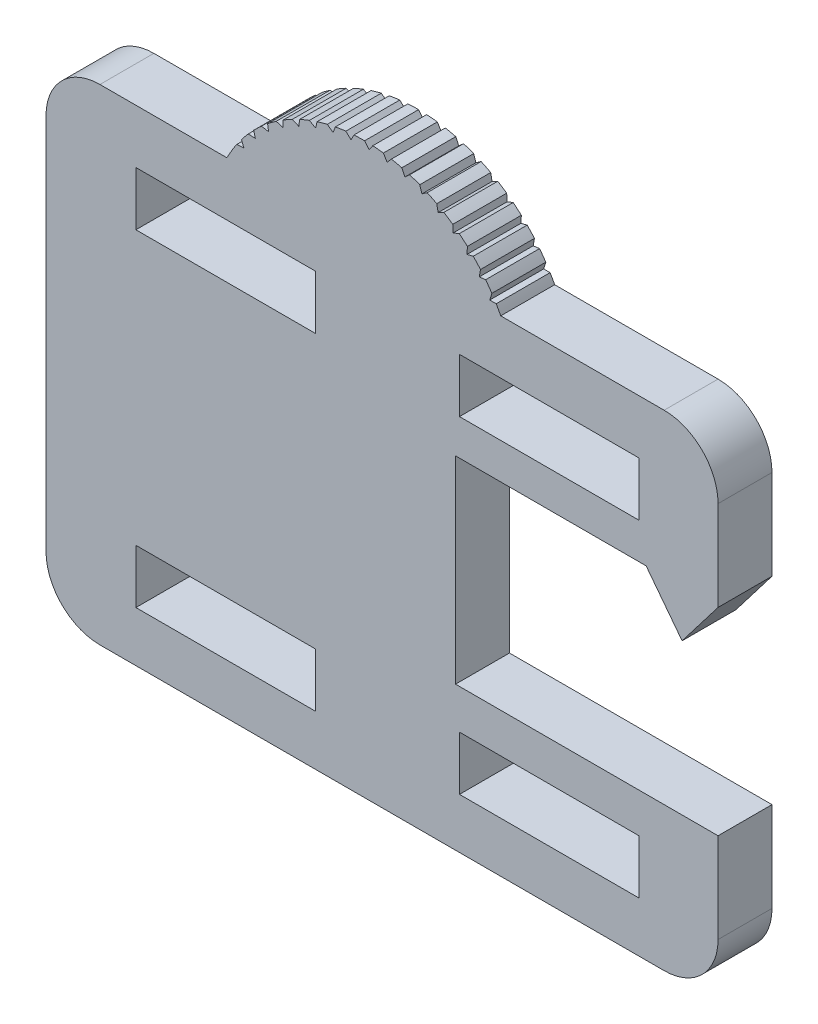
ISO-10303-21;
HEADER;
FILE_DESCRIPTION(('STEP AP214'),'2;1');
FILE_NAME('part.step','',(''),(''),'','','');
FILE_SCHEMA(('AUTOMOTIVE_DESIGN { 1 0 10303 214 1 1 1 1 }'));
ENDSEC;
DATA;
#1=APPLICATION_CONTEXT('core data for automotive mechanical design processes');
#2=APPLICATION_PROTOCOL_DEFINITION('international standard','automotive_design',2000,#1);
#3=PRODUCT_CONTEXT('',#1,'mechanical');
#4=PRODUCT('Part','Part','',(#3));
#5=PRODUCT_RELATED_PRODUCT_CATEGORY('part','',(#4));
#6=PRODUCT_DEFINITION_FORMATION('','',#4);
#7=PRODUCT_DEFINITION_CONTEXT('part definition',#1,'design');
#8=PRODUCT_DEFINITION('design','',#6,#7);
#9=PRODUCT_DEFINITION_SHAPE('','',#8);
#10=(LENGTH_UNIT() NAMED_UNIT(*) SI_UNIT(.MILLI.,.METRE.));
#11=(NAMED_UNIT(*) PLANE_ANGLE_UNIT() SI_UNIT($,.RADIAN.));
#12=(NAMED_UNIT(*) SI_UNIT($,.STERADIAN.) SOLID_ANGLE_UNIT());
#13=UNCERTAINTY_MEASURE_WITH_UNIT(LENGTH_MEASURE(1.E-05),#10,'distance_accuracy_value','');
#14=(GEOMETRIC_REPRESENTATION_CONTEXT(3) GLOBAL_UNCERTAINTY_ASSIGNED_CONTEXT((#13)) GLOBAL_UNIT_ASSIGNED_CONTEXT((#10,
#11,#12)) REPRESENTATION_CONTEXT('',''));
#15=CARTESIAN_POINT('',(0.,0.,0.));
#16=DIRECTION('',(0.,0.,1.));
#17=DIRECTION('',(1.,0.,0.));
#18=AXIS2_PLACEMENT_3D('',#15,#16,#17);
#19=CARTESIAN_POINT('',(-27.7061345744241,17.2885031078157,0.));
#20=DIRECTION('',(0.,0.,1.));
#21=DIRECTION('',(1.,0.,0.));
#22=AXIS2_PLACEMENT_3D('',#19,#20,#21);
#23=CYLINDRICAL_SURFACE('',#22,8.56157031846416);
#24=DIRECTION('',(0.,0.,1.));
#25=VECTOR('',#24,1.);
#26=CARTESIAN_POINT('',(-34.5145995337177,22.4793885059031,0.));
#27=LINE('',#26,#25);
#28=CARTESIAN_POINT('',(-34.5145995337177,22.4793885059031,0.));
#29=VERTEX_POINT('',#28);
#30=CARTESIAN_POINT('',(-34.5145995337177,22.4793885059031,3.));
#31=VERTEX_POINT('',#30);
#32=EDGE_CURVE('E553',#29,#31,#27,.T.);
#33=ORIENTED_EDGE('',*,*,#32,.T.);
#34=CARTESIAN_POINT('',(-27.7061345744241,17.2885031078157,3.));
#35=DIRECTION('',(0.,0.,1.));
#36=DIRECTION('',(1.,0.,0.));
#37=AXIS2_PLACEMENT_3D('',#34,#35,#36);
#38=CIRCLE('',#37,8.56157031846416);
#39=CARTESIAN_POINT('',(-34.1378800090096,22.9394443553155,3.));
#40=VERTEX_POINT('',#39);
#41=EDGE_CURVE('E1371',#40,#31,#38,.T.);
#42=ORIENTED_EDGE('',*,*,#41,.F.);
#43=DIRECTION('',(0.,0.,1.));
#44=VECTOR('',#43,1.);
#45=CARTESIAN_POINT('',(-34.1378800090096,22.9394443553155,0.));
#46=LINE('',#45,#44);
#47=CARTESIAN_POINT('',(-34.1378800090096,22.9394443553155,0.));
#48=VERTEX_POINT('',#47);
#49=EDGE_CURVE('E582',#48,#40,#46,.T.);
#50=ORIENTED_EDGE('',*,*,#49,.F.);
#51=CARTESIAN_POINT('',(-27.7061345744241,17.2885031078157,0.));
#52=DIRECTION('',(0.,0.,1.));
#53=DIRECTION('',(1.,0.,0.));
#54=AXIS2_PLACEMENT_3D('',#51,#52,#53);
#55=CIRCLE('',#54,8.56157031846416);
#56=EDGE_CURVE('E1251',#48,#29,#55,.T.);
#57=ORIENTED_EDGE('',*,*,#56,.T.);
#58=EDGE_LOOP('',(#33,#42,#50,#57));
#59=FACE_BOUND('',#58,.T.);
#60=ADVANCED_FACE('F33',(#59),#23,.T.);
#61=DIRECTION('',(0.,0.,1.));
#62=VECTOR('',#61,1.);
#63=CARTESIAN_POINT('',(-33.8312404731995,23.2704395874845,0.));
#64=LINE('',#63,#62);
#65=CARTESIAN_POINT('',(-33.8312404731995,23.2704395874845,0.));
#66=VERTEX_POINT('',#65);
#67=CARTESIAN_POINT('',(-33.8312404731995,23.2704395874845,3.));
#68=VERTEX_POINT('',#67);
#69=EDGE_CURVE('E586',#66,#68,#64,.T.);
#70=ORIENTED_EDGE('',*,*,#69,.T.);
#71=CARTESIAN_POINT('',(-33.4012622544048,23.6811556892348,3.));
#72=VERTEX_POINT('',#71);
#73=EDGE_CURVE('E1366',#72,#68,#38,.T.);
#74=ORIENTED_EDGE('',*,*,#73,.F.);
#75=DIRECTION('',(0.,0.,1.));
#76=VECTOR('',#75,1.);
#77=CARTESIAN_POINT('',(-33.4012622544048,23.6811556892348,0.));
#78=LINE('',#77,#76);
#79=CARTESIAN_POINT('',(-33.4012622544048,23.6811556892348,0.));
#80=VERTEX_POINT('',#79);
#81=EDGE_CURVE('E600',#80,#72,#78,.T.);
#82=ORIENTED_EDGE('',*,*,#81,.F.);
#83=EDGE_CURVE('E1246',#80,#66,#55,.T.);
#84=ORIENTED_EDGE('',*,*,#83,.T.);
#85=EDGE_LOOP('',(#70,#74,#82,#84));
#86=FACE_BOUND('',#85,.T.);
#87=ADVANCED_FACE('F1273',(#86),#23,.T.);
#88=DIRECTION('',(0.,0.,1.));
#89=VECTOR('',#88,1.);
#90=CARTESIAN_POINT('',(-33.0565701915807,23.9723137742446,0.));
#91=LINE('',#90,#89);
#92=CARTESIAN_POINT('',(-33.0565701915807,23.9723137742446,0.));
#93=VERTEX_POINT('',#92);
#94=CARTESIAN_POINT('',(-33.0565701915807,23.9723137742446,3.));
#95=VERTEX_POINT('',#94);
#96=EDGE_CURVE('E604',#93,#95,#91,.T.);
#97=ORIENTED_EDGE('',*,*,#96,.T.);
#98=CARTESIAN_POINT('',(-32.5797432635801,24.3275672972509,3.));
#99=VERTEX_POINT('',#98);
#100=EDGE_CURVE('E1361',#99,#95,#38,.T.);
#101=ORIENTED_EDGE('',*,*,#100,.F.);
#102=DIRECTION('',(0.,0.,1.));
#103=VECTOR('',#102,1.);
#104=CARTESIAN_POINT('',(-32.5797432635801,24.3275672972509,0.));
#105=LINE('',#104,#103);
#106=CARTESIAN_POINT('',(-32.5797432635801,24.3275672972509,0.));
#107=VERTEX_POINT('',#106);
#108=EDGE_CURVE('E618',#107,#99,#105,.T.);
#109=ORIENTED_EDGE('',*,*,#108,.F.);
#110=EDGE_CURVE('E1241',#107,#93,#55,.T.);
#111=ORIENTED_EDGE('',*,*,#110,.T.);
#112=EDGE_LOOP('',(#97,#101,#109,#111));
#113=FACE_BOUND('',#112,.T.);
#114=ADVANCED_FACE('F1278',(#113),#23,.T.);
#115=DIRECTION('',(0.,0.,1.));
#116=VECTOR('',#115,1.);
#117=CARTESIAN_POINT('',(-32.2021372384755,24.5745477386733,0.));
#118=LINE('',#117,#116);
#119=CARTESIAN_POINT('',(-32.2021372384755,24.5745477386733,0.));
#120=VERTEX_POINT('',#119);
#121=CARTESIAN_POINT('',(-32.2021372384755,24.5745477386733,3.));
#122=VERTEX_POINT('',#121);
#123=EDGE_CURVE('E622',#120,#122,#118,.T.);
#124=ORIENTED_EDGE('',*,*,#123,.T.);
#125=CARTESIAN_POINT('',(-31.6855699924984,24.8690426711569,3.));
#126=VERTEX_POINT('',#125);
#127=EDGE_CURVE('E1356',#126,#122,#38,.T.);
#128=ORIENTED_EDGE('',*,*,#127,.F.);
#129=DIRECTION('',(0.,0.,1.));
#130=VECTOR('',#129,1.);
#131=CARTESIAN_POINT('',(-31.6855699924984,24.8690426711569,0.));
#132=LINE('',#131,#130);
#133=CARTESIAN_POINT('',(-31.6855699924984,24.8690426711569,0.));
#134=VERTEX_POINT('',#133);
#135=EDGE_CURVE('E636',#134,#126,#132,.T.);
#136=ORIENTED_EDGE('',*,*,#135,.F.);
#137=EDGE_CURVE('E1236',#134,#120,#55,.T.);
#138=ORIENTED_EDGE('',*,*,#137,.T.);
#139=EDGE_LOOP('',(#124,#128,#136,#138));
#140=FACE_BOUND('',#139,.T.);
#141=ADVANCED_FACE('F1391',(#140),#23,.T.);
#142=DIRECTION('',(0.,0.,1.));
#143=VECTOR('',#142,1.);
#144=CARTESIAN_POINT('',(-31.2806792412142,25.0681635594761,0.));
#145=LINE('',#144,#143);
#146=CARTESIAN_POINT('',(-31.2806792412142,25.0681635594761,0.));
#147=VERTEX_POINT('',#146);
#148=CARTESIAN_POINT('',(-31.2806792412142,25.0681635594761,3.));
#149=VERTEX_POINT('',#148);
#150=EDGE_CURVE('E640',#147,#149,#145,.T.);
#151=ORIENTED_EDGE('',*,*,#150,.T.);
#152=CARTESIAN_POINT('',(-30.7320725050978,25.2975096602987,3.));
#153=VERTEX_POINT('',#152);
#154=EDGE_CURVE('E1351',#153,#149,#38,.T.);
#155=ORIENTED_EDGE('',*,*,#154,.F.);
#156=DIRECTION('',(0.,0.,1.));
#157=VECTOR('',#156,1.);
#158=CARTESIAN_POINT('',(-30.7320725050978,25.2975096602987,0.));
#159=LINE('',#158,#157);
#160=CARTESIAN_POINT('',(-30.7320725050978,25.2975096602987,0.));
#161=VERTEX_POINT('',#160);
#162=EDGE_CURVE('E654',#161,#153,#159,.T.);
#163=ORIENTED_EDGE('',*,*,#162,.F.);
#164=EDGE_CURVE('E1231',#161,#147,#55,.T.);
#165=ORIENTED_EDGE('',*,*,#164,.T.);
#166=EDGE_LOOP('',(#151,#155,#163,#165));
#167=FACE_BOUND('',#166,.T.);
#168=ADVANCED_FACE('F1397',(#167),#23,.T.);
#169=DIRECTION('',(0.,0.,1.));
#170=VECTOR('',#169,1.);
#171=CARTESIAN_POINT('',(-30.3059330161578,25.4458025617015,0.));
#172=LINE('',#171,#170);
#173=CARTESIAN_POINT('',(-30.3059330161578,25.4458025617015,0.));
#174=VERTEX_POINT('',#173);
#175=CARTESIAN_POINT('',(-30.3059330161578,25.4458025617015,3.));
#176=VERTEX_POINT('',#175);
#177=EDGE_CURVE('E658',#174,#176,#172,.T.);
#178=ORIENTED_EDGE('',*,*,#177,.T.);
#179=CARTESIAN_POINT('',(-29.7334652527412,25.6065808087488,3.));
#180=VERTEX_POINT('',#179);
#181=EDGE_CURVE('E1346',#180,#176,#38,.T.);
#182=ORIENTED_EDGE('',*,*,#181,.F.);
#183=DIRECTION('',(0.,0.,1.));
#184=VECTOR('',#183,1.);
#185=CARTESIAN_POINT('',(-29.7334652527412,25.6065808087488,0.));
#186=LINE('',#185,#184);
#187=CARTESIAN_POINT('',(-29.7334652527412,25.6065808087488,0.));
#188=VERTEX_POINT('',#187);
#189=EDGE_CURVE('E672',#188,#180,#186,.T.);
#190=ORIENTED_EDGE('',*,*,#189,.F.);
#191=EDGE_CURVE('E1226',#188,#174,#55,.T.);
#192=ORIENTED_EDGE('',*,*,#191,.T.);
#193=EDGE_LOOP('',(#178,#182,#190,#192));
#194=FACE_BOUND('',#193,.T.);
#195=ADVANCED_FACE('F1403',(#194),#23,.T.);
#196=DIRECTION('',(0.,0.,1.));
#197=VECTOR('',#196,1.);
#198=CARTESIAN_POINT('',(-29.2924297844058,25.7018350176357,0.));
#199=LINE('',#198,#197);
#200=CARTESIAN_POINT('',(-29.2924297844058,25.7018350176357,0.));
#201=VERTEX_POINT('',#200);
#202=CARTESIAN_POINT('',(-29.2924297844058,25.7018350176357,3.));
#203=VERTEX_POINT('',#202);
#204=EDGE_CURVE('E676',#201,#203,#199,.T.);
#205=ORIENTED_EDGE('',*,*,#204,.T.);
#206=CARTESIAN_POINT('',(-28.7046351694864,25.7916485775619,3.));
#207=VERTEX_POINT('',#206);
#208=EDGE_CURVE('E1341',#207,#203,#38,.T.);
#209=ORIENTED_EDGE('',*,*,#208,.F.);
#210=DIRECTION('',(0.,0.,1.));
#211=VECTOR('',#210,1.);
#212=CARTESIAN_POINT('',(-28.7046351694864,25.7916485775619,0.));
#213=LINE('',#212,#211);
#214=CARTESIAN_POINT('',(-28.7046351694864,25.7916485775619,0.));
#215=VERTEX_POINT('',#214);
#216=EDGE_CURVE('E690',#215,#207,#213,.T.);
#217=ORIENTED_EDGE('',*,*,#216,.F.);
#218=EDGE_CURVE('E1221',#215,#201,#55,.T.);
#219=ORIENTED_EDGE('',*,*,#218,.T.);
#220=EDGE_LOOP('',(#205,#209,#217,#219));
#221=FACE_BOUND('',#220,.T.);
#222=ADVANCED_FACE('F1409',(#221),#23,.T.);
#223=DIRECTION('',(0.,0.,1.));
#224=VECTOR('',#223,1.);
#225=CARTESIAN_POINT('',(-28.2552785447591,25.8324440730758,0.));
#226=LINE('',#225,#224);
#227=CARTESIAN_POINT('',(-28.2552785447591,25.8324440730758,0.));
#228=VERTEX_POINT('',#227);
#229=CARTESIAN_POINT('',(-28.2552785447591,25.8324440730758,3.));
#230=VERTEX_POINT('',#229);
#231=EDGE_CURVE('E694',#228,#230,#226,.T.);
#232=ORIENTED_EDGE('',*,*,#231,.T.);
#233=CARTESIAN_POINT('',(-27.6609197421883,25.8499540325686,3.));
#234=VERTEX_POINT('',#233);
#235=EDGE_CURVE('E1336',#234,#230,#38,.T.);
#236=ORIENTED_EDGE('',*,*,#235,.F.);
#237=DIRECTION('',(0.,0.,1.));
#238=VECTOR('',#237,1.);
#239=CARTESIAN_POINT('',(-27.6609197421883,25.8499540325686,0.));
#240=LINE('',#239,#238);
#241=CARTESIAN_POINT('',(-27.6609197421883,25.8499540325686,0.));
#242=VERTEX_POINT('',#241);
#243=EDGE_CURVE('E708',#242,#234,#240,.T.);
#244=ORIENTED_EDGE('',*,*,#243,.F.);
#245=EDGE_CURVE('E1216',#242,#228,#55,.T.);
#246=ORIENTED_EDGE('',*,*,#245,.T.);
#247=EDGE_LOOP('',(#232,#236,#244,#246));
#248=FACE_BOUND('',#247,.T.);
#249=ADVANCED_FACE('F1415',(#248),#23,.T.);
#250=DIRECTION('',(0.,0.,1.));
#251=VECTOR('',#250,1.);
#252=CARTESIAN_POINT('',(-27.2099408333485,25.8356826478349,0.));
#253=LINE('',#252,#251);
#254=CARTESIAN_POINT('',(-27.2099408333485,25.8356826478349,0.));
#255=VERTEX_POINT('',#254);
#256=CARTESIAN_POINT('',(-27.2099408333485,25.8356826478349,3.));
#257=VERTEX_POINT('',#256);
#258=EDGE_CURVE('E712',#255,#257,#253,.T.);
#259=ORIENTED_EDGE('',*,*,#258,.T.);
#260=CARTESIAN_POINT('',(-26.6178783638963,25.7806279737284,3.));
#261=VERTEX_POINT('',#260);
#262=EDGE_CURVE('E1331',#261,#257,#38,.T.);
#263=ORIENTED_EDGE('',*,*,#262,.F.);
#264=DIRECTION('',(0.,0.,1.));
#265=VECTOR('',#264,1.);
#266=CARTESIAN_POINT('',(-26.6178783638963,25.7806279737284,0.));
#267=LINE('',#266,#265);
#268=CARTESIAN_POINT('',(-26.6178783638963,25.7806279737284,0.));
#269=VERTEX_POINT('',#268);
#270=EDGE_CURVE('E726',#269,#261,#267,.T.);
#271=ORIENTED_EDGE('',*,*,#270,.F.);
#272=EDGE_CURVE('E1211',#269,#255,#55,.T.);
#273=ORIENTED_EDGE('',*,*,#272,.T.);
#274=EDGE_LOOP('',(#259,#263,#271,#273));
#275=FACE_BOUND('',#274,.T.);
#276=ADVANCED_FACE('F1421',(#275),#23,.T.);
#277=DIRECTION('',(0.,0.,1.));
#278=VECTOR('',#277,1.);
#279=CARTESIAN_POINT('',(-26.172000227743,25.7115024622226,0.));
#280=LINE('',#279,#278);
#281=CARTESIAN_POINT('',(-26.172000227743,25.7115024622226,0.));
#282=VERTEX_POINT('',#281);
#283=CARTESIAN_POINT('',(-26.172000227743,25.7115024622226,3.));
#284=VERTEX_POINT('',#283);
#285=EDGE_CURVE('E730',#282,#284,#280,.T.);
#286=ORIENTED_EDGE('',*,*,#285,.T.);
#287=CARTESIAN_POINT('',(-25.5910603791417,25.5847038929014,3.));
#288=VERTEX_POINT('',#287);
#289=EDGE_CURVE('E1326',#288,#284,#38,.T.);
#290=ORIENTED_EDGE('',*,*,#289,.F.);
#291=DIRECTION('',(0.,0.,1.));
#292=VECTOR('',#291,1.);
#293=CARTESIAN_POINT('',(-25.5910603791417,25.5847038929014,0.));
#294=LINE('',#293,#292);
#295=CARTESIAN_POINT('',(-25.5910603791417,25.5847038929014,0.));
#296=VERTEX_POINT('',#295);
#297=EDGE_CURVE('E744',#296,#288,#294,.T.);
#298=ORIENTED_EDGE('',*,*,#297,.F.);
#299=EDGE_CURVE('E1206',#296,#282,#55,.T.);
#300=ORIENTED_EDGE('',*,*,#299,.T.);
#301=EDGE_LOOP('',(#286,#290,#298,#300));
#302=FACE_BOUND('',#301,.T.);
#303=ADVANCED_FACE('F1427',(#302),#23,.T.);
#304=DIRECTION('',(0.,0.,1.));
#305=VECTOR('',#304,1.);
#306=CARTESIAN_POINT('',(-25.1569300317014,25.4617547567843,0.));
#307=LINE('',#306,#305);
#308=CARTESIAN_POINT('',(-25.1569300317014,25.4617547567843,0.));
#309=VERTEX_POINT('',#308);
#310=CARTESIAN_POINT('',(-25.1569300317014,25.4617547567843,3.));
#311=VERTEX_POINT('',#310);
#312=EDGE_CURVE('E748',#309,#311,#307,.T.);
#313=ORIENTED_EDGE('',*,*,#312,.T.);
#314=CARTESIAN_POINT('',(-24.595773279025,25.2651025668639,3.));
#315=VERTEX_POINT('',#314);
#316=EDGE_CURVE('E1321',#315,#311,#38,.T.);
#317=ORIENTED_EDGE('',*,*,#316,.F.);
#318=DIRECTION('',(0.,0.,1.));
#319=VECTOR('',#318,1.);
#320=CARTESIAN_POINT('',(-24.595773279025,25.2651025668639,0.));
#321=LINE('',#320,#319);
#322=CARTESIAN_POINT('',(-24.595773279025,25.2651025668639,0.));
#323=VERTEX_POINT('',#322);
#324=EDGE_CURVE('E762',#323,#315,#321,.T.);
#325=ORIENTED_EDGE('',*,*,#324,.F.);
#326=EDGE_CURVE('E1201',#323,#309,#55,.T.);
#327=ORIENTED_EDGE('',*,*,#326,.T.);
#328=EDGE_LOOP('',(#313,#317,#325,#327));
#329=FACE_BOUND('',#328,.T.);
#330=ADVANCED_FACE('F1433',(#329),#23,.T.);
#331=DIRECTION('',(0.,0.,1.));
#332=VECTOR('',#331,1.);
#333=CARTESIAN_POINT('',(-24.1798626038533,25.0901626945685,0.));
#334=LINE('',#333,#332);
#335=CARTESIAN_POINT('',(-24.1798626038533,25.0901626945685,0.));
#336=VERTEX_POINT('',#335);
#337=CARTESIAN_POINT('',(-24.1798626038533,25.0901626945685,3.));
#338=VERTEX_POINT('',#337);
#339=EDGE_CURVE('E766',#336,#338,#334,.T.);
#340=ORIENTED_EDGE('',*,*,#339,.T.);
#341=CARTESIAN_POINT('',(-23.6468545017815,24.8265885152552,3.));
#342=VERTEX_POINT('',#341);
#343=EDGE_CURVE('E1316',#342,#338,#38,.T.);
#344=ORIENTED_EDGE('',*,*,#343,.F.);
#345=DIRECTION('',(0.,0.,1.));
#346=VECTOR('',#345,1.);
#347=CARTESIAN_POINT('',(-23.6468545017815,24.8265885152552,0.));
#348=LINE('',#347,#346);
#349=CARTESIAN_POINT('',(-23.6468545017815,24.8265885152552,0.));
#350=VERTEX_POINT('',#349);
#351=EDGE_CURVE('E780',#350,#342,#348,.T.);
#352=ORIENTED_EDGE('',*,*,#351,.F.);
#353=EDGE_CURVE('E1196',#350,#336,#55,.T.);
#354=ORIENTED_EDGE('',*,*,#353,.T.);
#355=EDGE_LOOP('',(#340,#344,#352,#354));
#356=FACE_BOUND('',#355,.T.);
#357=ADVANCED_FACE('F1439',(#356),#23,.T.);
#358=DIRECTION('',(0.,0.,1.));
#359=VECTOR('',#358,1.);
#360=CARTESIAN_POINT('',(-23.2553637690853,24.6022658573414,0.));
#361=LINE('',#360,#359);
#362=CARTESIAN_POINT('',(-23.2553637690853,24.6022658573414,0.));
#363=VERTEX_POINT('',#362);
#364=CARTESIAN_POINT('',(-23.2553637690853,24.6022658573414,3.));
#365=VERTEX_POINT('',#364);
#366=EDGE_CURVE('E784',#363,#365,#361,.T.);
#367=ORIENTED_EDGE('',*,*,#366,.T.);
#368=CARTESIAN_POINT('',(-22.7584502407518,24.2756989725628,3.));
#369=VERTEX_POINT('',#368);
#370=EDGE_CURVE('E1312',#369,#365,#38,.T.);
#371=ORIENTED_EDGE('',*,*,#370,.F.);
#372=DIRECTION('',(0.,0.,1.));
#373=VECTOR('',#372,1.);
#374=CARTESIAN_POINT('',(-22.7584502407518,24.2756989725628,0.));
#375=LINE('',#374,#373);
#376=CARTESIAN_POINT('',(-22.7584502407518,24.2756989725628,0.));
#377=VERTEX_POINT('',#376);
#378=EDGE_CURVE('E798',#377,#369,#375,.T.);
#379=ORIENTED_EDGE('',*,*,#378,.F.);
#380=EDGE_CURVE('E1191',#377,#363,#55,.T.);
#381=ORIENTED_EDGE('',*,*,#380,.T.);
#382=EDGE_LOOP('',(#367,#371,#379,#381));
#383=FACE_BOUND('',#382,.T.);
#384=ADVANCED_FACE('F1300',(#383),#23,.T.);
#385=DIRECTION('',(0.,0.,1.));
#386=VECTOR('',#385,1.);
#387=CARTESIAN_POINT('',(-22.3972156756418,24.0053376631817,0.));
#388=LINE('',#387,#386);
#389=CARTESIAN_POINT('',(-22.3972156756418,24.0053376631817,0.));
#390=VERTEX_POINT('',#389);
#391=CARTESIAN_POINT('',(-22.3972156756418,24.0053376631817,3.));
#392=VERTEX_POINT('',#391);
#393=EDGE_CURVE('E802',#390,#392,#388,.T.);
#394=ORIENTED_EDGE('',*,*,#393,.T.);
#395=CARTESIAN_POINT('',(-21.9438045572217,23.6206464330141,3.));
#396=VERTEX_POINT('',#395);
#397=EDGE_CURVE('E1310',#396,#392,#38,.T.);
#398=ORIENTED_EDGE('',*,*,#397,.F.);
#399=DIRECTION('',(0.,0.,1.));
#400=VECTOR('',#399,1.);
#401=CARTESIAN_POINT('',(-21.9438045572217,23.6206464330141,0.));
#402=LINE('',#401,#400);
#403=CARTESIAN_POINT('',(-21.9438045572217,23.6206464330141,0.));
#404=VERTEX_POINT('',#403);
#405=EDGE_CURVE('E816',#404,#396,#402,.T.);
#406=ORIENTED_EDGE('',*,*,#405,.F.);
#407=EDGE_CURVE('E1186',#404,#390,#55,.T.);
#408=ORIENTED_EDGE('',*,*,#407,.T.);
#409=EDGE_LOOP('',(#394,#398,#406,#408));
#410=FACE_BOUND('',#409,.T.);
#411=ADVANCED_FACE('F1296',(#410),#23,.T.);
#412=DIRECTION('',(0.,0.,1.));
#413=VECTOR('',#412,1.);
#414=CARTESIAN_POINT('',(-21.6182113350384,23.3082769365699,0.));
#415=LINE('',#414,#413);
#416=CARTESIAN_POINT('',(-21.6182113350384,23.3082769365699,0.));
#417=VERTEX_POINT('',#416);
#418=CARTESIAN_POINT('',(-21.6182113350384,23.3082769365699,3.));
#419=VERTEX_POINT('',#418);
#420=EDGE_CURVE('E820',#417,#419,#415,.T.);
#421=ORIENTED_EDGE('',*,*,#420,.T.);
#422=CARTESIAN_POINT('',(-21.2150619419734,22.8711962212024,3.));
#423=VERTEX_POINT('',#422);
#424=EDGE_CURVE('E1303',#423,#419,#38,.T.);
#425=ORIENTED_EDGE('',*,*,#424,.F.);
#426=DIRECTION('',(0.,0.,1.));
#427=VECTOR('',#426,1.);
#428=CARTESIAN_POINT('',(-21.2150619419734,22.8711962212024,0.));
#429=LINE('',#428,#427);
#430=CARTESIAN_POINT('',(-21.2150619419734,22.8711962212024,0.));
#431=VERTEX_POINT('',#430);
#432=EDGE_CURVE('E834',#431,#423,#429,.T.);
#433=ORIENTED_EDGE('',*,*,#432,.F.);
#434=EDGE_CURVE('E1184',#431,#417,#55,.T.);
#435=ORIENTED_EDGE('',*,*,#434,.T.);
#436=EDGE_LOOP('',(#421,#425,#433,#435));
#437=FACE_BOUND('',#436,.T.);
#438=ADVANCED_FACE('F1292',(#437),#23,.T.);
#439=DIRECTION('',(0.,0.,1.));
#440=VECTOR('',#439,1.);
#441=CARTESIAN_POINT('',(-20.9299639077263,22.5214752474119,0.));
#442=LINE('',#441,#440);
#443=CARTESIAN_POINT('',(-20.9299639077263,22.5214752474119,0.));
#444=VERTEX_POINT('',#443);
#445=CARTESIAN_POINT('',(-20.9299639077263,22.5214752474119,3.));
#446=VERTEX_POINT('',#445);
#447=EDGE_CURVE('E838',#444,#446,#442,.T.);
#448=ORIENTED_EDGE('',*,*,#447,.T.);
#449=CARTESIAN_POINT('',(-20.5830862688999,22.0385209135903,3.));
#450=VERTEX_POINT('',#449);
#451=EDGE_CURVE('E871',#450,#446,#38,.T.);
#452=ORIENTED_EDGE('',*,*,#451,.F.);
#453=DIRECTION('',(0.,0.,1.));
#454=VECTOR('',#453,1.);
#455=CARTESIAN_POINT('',(-20.5830862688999,22.0385209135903,0.));
#456=LINE('',#455,#454);
#457=CARTESIAN_POINT('',(-20.5830862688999,22.0385209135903,0.));
#458=VERTEX_POINT('',#457);
#459=EDGE_CURVE('E852',#458,#450,#456,.T.);
#460=ORIENTED_EDGE('',*,*,#459,.F.);
#461=EDGE_CURVE('E867',#458,#444,#55,.T.);
#462=ORIENTED_EDGE('',*,*,#461,.T.);
#463=EDGE_LOOP('',(#448,#452,#460,#462));
#464=FACE_BOUND('',#463,.T.);
#465=ADVANCED_FACE('F1182',(#464),#23,.T.);
#466=DIRECTION('',(0.,0.,1.));
#467=VECTOR('',#466,1.);
#468=CARTESIAN_POINT('',(-20.3427335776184,21.6566619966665,0.));
#469=LINE('',#468,#467);
#470=CARTESIAN_POINT('',(-20.3427335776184,21.6566619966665,0.));
#471=VERTEX_POINT('',#470);
#472=CARTESIAN_POINT('',(-20.3427335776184,21.6566619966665,3.));
#473=VERTEX_POINT('',#472);
#474=EDGE_CURVE('E856',#471,#473,#469,.T.);
#475=ORIENTED_EDGE('',*,*,#474,.T.);
#476=CARTESIAN_POINT('',(-20.0903169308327,21.2,3.));
#477=VERTEX_POINT('',#476);
#478=EDGE_CURVE('E868',#477,#473,#38,.T.);
#479=ORIENTED_EDGE('',*,*,#478,.F.);
#480=DIRECTION('',(0.,0.,1.));
#481=VECTOR('',#480,1.);
#482=CARTESIAN_POINT('',(-20.0903169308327,21.2,0.));
#483=LINE('',#482,#481);
#484=CARTESIAN_POINT('',(-20.0903169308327,21.2,0.));
#485=VERTEX_POINT('',#484);
#486=EDGE_CURVE('E872',#485,#477,#483,.T.);
#487=ORIENTED_EDGE('',*,*,#486,.F.);
#488=EDGE_CURVE('E863',#485,#471,#55,.T.);
#489=ORIENTED_EDGE('',*,*,#488,.T.);
#490=EDGE_LOOP('',(#475,#479,#487,#489));
#491=FACE_BOUND('',#490,.T.);
#492=ADVANCED_FACE('F1169',(#491),#23,.T.);
#493=CARTESIAN_POINT('',(-8.,21.2,3.));
#494=DIRECTION('',(0.,-1.,0.));
#495=DIRECTION('',(0.,0.,-1.));
#496=AXIS2_PLACEMENT_3D('',#493,#494,#495);
#497=PLANE('',#496);
#498=DIRECTION('',(-1.,0.,0.));
#499=VECTOR('',#498,1.);
#500=CARTESIAN_POINT('',(-8.,21.2,0.));
#501=LINE('',#500,#499);
#502=CARTESIAN_POINT('',(-11.,21.2,0.));
#503=VERTEX_POINT('',#502);
#504=EDGE_CURVE('E1054',#503,#485,#501,.T.);
#505=ORIENTED_EDGE('',*,*,#504,.T.);
#506=ORIENTED_EDGE('',*,*,#486,.T.);
#507=DIRECTION('',(-1.,0.,0.));
#508=VECTOR('',#507,1.);
#509=CARTESIAN_POINT('',(-8.,21.2,3.));
#510=LINE('',#509,#508);
#511=CARTESIAN_POINT('',(-11.,21.2,3.));
#512=VERTEX_POINT('',#511);
#513=EDGE_CURVE('E1032',#512,#477,#510,.T.);
#514=ORIENTED_EDGE('',*,*,#513,.F.);
#515=DIRECTION('',(0.,0.,-1.));
#516=VECTOR('',#515,1.);
#517=CARTESIAN_POINT('',(-11.,21.2,3.));
#518=LINE('',#517,#516);
#519=EDGE_CURVE('E1076',#512,#503,#518,.T.);
#520=ORIENTED_EDGE('',*,*,#519,.T.);
#521=EDGE_LOOP('',(#505,#506,#514,#520));
#522=FACE_BOUND('',#521,.T.);
#523=ADVANCED_FACE('F1165',(#522),#497,.F.);
#524=CARTESIAN_POINT('',(0.,0.,3.));
#525=DIRECTION('',(0.,0.,1.));
#526=DIRECTION('',(1.,0.,0.));
#527=AXIS2_PLACEMENT_3D('',#524,#525,#526);
#528=PLANE('',#527);
#529=DIRECTION('',(-0.374606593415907,0.92718385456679,0.));
#530=VECTOR('',#529,1.);
#531=CARTESIAN_POINT('',(-34.5145995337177,22.4793885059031,3.));
#532=LINE('',#531,#530);
#533=CARTESIAN_POINT('',(-34.3804544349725,22.1473677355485,3.));
#534=VERTEX_POINT('',#533);
#535=EDGE_CURVE('E569',#534,#31,#532,.T.);
#536=ORIENTED_EDGE('',*,*,#535,.F.);
#537=DIRECTION('',(0.996399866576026,0.0847779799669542,0.));
#538=VECTOR('',#537,1.);
#539=CARTESIAN_POINT('',(-34.3804544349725,22.1473677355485,3.));
#540=LINE('',#539,#538);
#541=CARTESIAN_POINT('',(-34.7786152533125,22.1134905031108,3.));
#542=VERTEX_POINT('',#541);
#543=EDGE_CURVE('E550',#542,#534,#540,.T.);
#544=ORIENTED_EDGE('',*,*,#543,.F.);
#545=CARTESIAN_POINT('',(-35.3219522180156,21.2,3.));
#546=VERTEX_POINT('',#545);
#547=EDGE_CURVE('E859',#542,#546,#38,.T.);
#548=ORIENTED_EDGE('',*,*,#547,.T.);
#549=CARTESIAN_POINT('',(-42.3846510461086,21.2,3.));
#550=VERTEX_POINT('',#549);
#551=EDGE_CURVE('E1031',#546,#550,#510,.T.);
#552=ORIENTED_EDGE('',*,*,#551,.T.);
#553=CARTESIAN_POINT('',(-42.3846510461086,18.2,3.));
#554=DIRECTION('',(0.,0.,1.));
#555=DIRECTION('',(1.,0.,0.));
#556=AXIS2_PLACEMENT_3D('',#553,#554,#555);
#557=CIRCLE('',#556,3.);
#558=CARTESIAN_POINT('',(-45.3846510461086,18.2,3.));
#559=VERTEX_POINT('',#558);
#560=EDGE_CURVE('E1092',#550,#559,#557,.T.);
#561=ORIENTED_EDGE('',*,*,#560,.T.);
#562=DIRECTION('',(0.,-1.,0.));
#563=VECTOR('',#562,1.);
#564=CARTESIAN_POINT('',(-45.3846510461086,-5.8,3.));
#565=LINE('',#564,#563);
#566=CARTESIAN_POINT('',(-45.3846510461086,-2.8,3.));
#567=VERTEX_POINT('',#566);
#568=EDGE_CURVE('E1035',#559,#567,#565,.T.);
#569=ORIENTED_EDGE('',*,*,#568,.T.);
#570=CARTESIAN_POINT('',(-42.3846510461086,-2.8,3.));
#571=DIRECTION('',(0.,0.,1.));
#572=DIRECTION('',(1.,0.,0.));
#573=AXIS2_PLACEMENT_3D('',#570,#571,#572);
#574=CIRCLE('',#573,3.);
#575=CARTESIAN_POINT('',(-42.3846510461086,-5.8,3.));
#576=VERTEX_POINT('',#575);
#577=EDGE_CURVE('E1090',#567,#576,#574,.T.);
#578=ORIENTED_EDGE('',*,*,#577,.T.);
#579=DIRECTION('',(1.,0.,0.));
#580=VECTOR('',#579,1.);
#581=CARTESIAN_POINT('',(-8.,-5.8,3.));
#582=LINE('',#581,#580);
#583=CARTESIAN_POINT('',(-11.,-5.8,3.));
#584=VERTEX_POINT('',#583);
#585=EDGE_CURVE('E1038',#576,#584,#582,.T.);
#586=ORIENTED_EDGE('',*,*,#585,.T.);
#587=CARTESIAN_POINT('',(-11.,-2.8,3.));
#588=DIRECTION('',(0.,0.,1.));
#589=DIRECTION('',(1.,0.,0.));
#590=AXIS2_PLACEMENT_3D('',#587,#588,#589);
#591=CIRCLE('',#590,3.);
#592=CARTESIAN_POINT('',(-8.,-2.8,3.));
#593=VERTEX_POINT('',#592);
#594=EDGE_CURVE('E1094',#584,#593,#591,.T.);
#595=ORIENTED_EDGE('',*,*,#594,.T.);
#596=DIRECTION('',(0.,1.,0.));
#597=VECTOR('',#596,1.);
#598=CARTESIAN_POINT('',(-8.,-5.8,3.));
#599=LINE('',#598,#597);
#600=CARTESIAN_POINT('',(-8.,2.2,3.));
#601=VERTEX_POINT('',#600);
#602=EDGE_CURVE('E1018',#593,#601,#599,.T.);
#603=ORIENTED_EDGE('',*,*,#602,.T.);
#604=DIRECTION('',(-1.,0.,0.));
#605=VECTOR('',#604,1.);
#606=CARTESIAN_POINT('',(-8.,2.2,3.));
#607=LINE('',#606,#605);
#608=CARTESIAN_POINT('',(-22.603381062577,2.2,3.));
#609=VERTEX_POINT('',#608);
#610=EDGE_CURVE('E1020',#601,#609,#607,.T.);
#611=ORIENTED_EDGE('',*,*,#610,.T.);
#612=DIRECTION('',(0.,1.,0.));
#613=VECTOR('',#612,1.);
#614=CARTESIAN_POINT('',(-22.603381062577,2.2,3.));
#615=LINE('',#614,#613);
#616=CARTESIAN_POINT('',(-22.603381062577,13.2,3.));
#617=VERTEX_POINT('',#616);
#618=EDGE_CURVE('E1023',#609,#617,#615,.T.);
#619=ORIENTED_EDGE('',*,*,#618,.T.);
#620=DIRECTION('',(1.,0.,0.));
#621=VECTOR('',#620,1.);
#622=CARTESIAN_POINT('',(-8.,13.2,3.));
#623=LINE('',#622,#621);
#624=CARTESIAN_POINT('',(-12.,13.2,3.));
#625=VERTEX_POINT('',#624);
#626=EDGE_CURVE('E1025',#617,#625,#623,.T.);
#627=ORIENTED_EDGE('',*,*,#626,.T.);
#628=DIRECTION('',(0.608417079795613,-0.793617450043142,0.));
#629=VECTOR('',#628,1.);
#630=CARTESIAN_POINT('',(-10.,10.5912058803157,3.));
#631=LINE('',#630,#629);
#632=CARTESIAN_POINT('',(-10.,10.5912058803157,3.));
#633=VERTEX_POINT('',#632);
#634=EDGE_CURVE('E875',#625,#633,#631,.T.);
#635=ORIENTED_EDGE('',*,*,#634,.T.);
#636=DIRECTION('',(0.608417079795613,0.793617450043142,0.));
#637=VECTOR('',#636,1.);
#638=CARTESIAN_POINT('',(-8.,13.2,3.));
#639=LINE('',#638,#637);
#640=CARTESIAN_POINT('',(-8.,13.2,3.));
#641=VERTEX_POINT('',#640);
#642=EDGE_CURVE('E882',#633,#641,#639,.T.);
#643=ORIENTED_EDGE('',*,*,#642,.T.);
#644=DIRECTION('',(0.,1.,0.));
#645=VECTOR('',#644,1.);
#646=CARTESIAN_POINT('',(-8.,13.2,3.));
#647=LINE('',#646,#645);
#648=CARTESIAN_POINT('',(-8.,18.2,3.));
#649=VERTEX_POINT('',#648);
#650=EDGE_CURVE('E1028',#641,#649,#647,.T.);
#651=ORIENTED_EDGE('',*,*,#650,.T.);
#652=CARTESIAN_POINT('',(-11.,18.2,3.));
#653=DIRECTION('',(0.,0.,1.));
#654=DIRECTION('',(1.,0.,0.));
#655=AXIS2_PLACEMENT_3D('',#652,#653,#654);
#656=CIRCLE('',#655,3.);
#657=EDGE_CURVE('E1096',#649,#512,#656,.T.);
#658=ORIENTED_EDGE('',*,*,#657,.T.);
#659=ORIENTED_EDGE('',*,*,#513,.T.);
#660=ORIENTED_EDGE('',*,*,#478,.T.);
#661=DIRECTION('',(1.,0.,0.));
#662=VECTOR('',#661,1.);
#663=CARTESIAN_POINT('',(-20.3427335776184,21.6566619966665,3.));
#664=LINE('',#663,#662);
#665=CARTESIAN_POINT('',(-20.7008295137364,21.6566619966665,3.));
#666=VERTEX_POINT('',#665);
#667=EDGE_CURVE('E849',#666,#473,#664,.T.);
#668=ORIENTED_EDGE('',*,*,#667,.F.);
#669=DIRECTION('',(-0.294653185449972,-0.955604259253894,0.));
#670=VECTOR('',#669,1.);
#671=CARTESIAN_POINT('',(-20.7008295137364,21.6566619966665,3.));
#672=LINE('',#671,#670);
#673=EDGE_CURVE('E841',#450,#666,#672,.T.);
#674=ORIENTED_EDGE('',*,*,#673,.F.);
#675=ORIENTED_EDGE('',*,*,#451,.T.);
#676=DIRECTION('',(0.992546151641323,0.121869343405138,0.));
#677=VECTOR('',#676,1.);
#678=CARTESIAN_POINT('',(-20.9299639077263,22.5214752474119,3.));
#679=LINE('',#678,#677);
#680=CARTESIAN_POINT('',(-21.2853906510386,22.4778343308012,3.));
#681=VERTEX_POINT('',#680);
#682=EDGE_CURVE('E831',#681,#446,#679,.T.);
#683=ORIENTED_EDGE('',*,*,#682,.F.);
#684=DIRECTION('',(-0.175998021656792,-0.984390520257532,0.));
#685=VECTOR('',#684,1.);
#686=CARTESIAN_POINT('',(-21.2853906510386,22.4778343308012,3.));
#687=LINE('',#686,#685);
#688=EDGE_CURVE('E823',#423,#681,#687,.T.);
#689=ORIENTED_EDGE('',*,*,#688,.F.);
#690=ORIENTED_EDGE('',*,*,#424,.T.);
#691=DIRECTION('',(0.970295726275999,0.241921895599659,0.));
#692=VECTOR('',#691,1.);
#693=CARTESIAN_POINT('',(-21.6182113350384,23.3082769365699,3.));
#694=LINE('',#693,#692);
#695=CARTESIAN_POINT('',(-21.9656702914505,23.2216456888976,3.));
#696=VERTEX_POINT('',#695);
#697=EDGE_CURVE('E813',#696,#419,#694,.T.);
#698=ORIENTED_EDGE('',*,*,#697,.F.);
#699=DIRECTION('',(-0.0547191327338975,-0.998501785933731,0.));
#700=VECTOR('',#699,1.);
#701=CARTESIAN_POINT('',(-21.9656702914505,23.2216456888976,3.));
#702=LINE('',#701,#700);
#703=EDGE_CURVE('E805',#396,#696,#702,.T.);
#704=ORIENTED_EDGE('',*,*,#703,.F.);
#705=ORIENTED_EDGE('',*,*,#397,.T.);
#706=DIRECTION('',(0.933580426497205,0.358367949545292,0.));
#707=VECTOR('',#706,1.);
#708=CARTESIAN_POINT('',(-22.3972156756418,24.0053376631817,3.));
#709=LINE('',#708,#707);
#710=CARTESIAN_POINT('',(-22.7315270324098,23.8770075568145,3.));
#711=VERTEX_POINT('',#710);
#712=EDGE_CURVE('E795',#711,#392,#709,.T.);
#713=ORIENTED_EDGE('',*,*,#712,.F.);
#714=DIRECTION('',(0.0673754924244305,-0.997727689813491,0.));
#715=VECTOR('',#714,1.);
#716=CARTESIAN_POINT('',(-22.7315270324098,23.8770075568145,3.));
#717=LINE('',#716,#715);
#718=EDGE_CURVE('E787',#369,#711,#717,.T.);
#719=ORIENTED_EDGE('',*,*,#718,.F.);
#720=ORIENTED_EDGE('',*,*,#370,.T.);
#721=DIRECTION('',(0.882947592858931,0.469471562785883,0.));
#722=VECTOR('',#721,1.);
#723=CARTESIAN_POINT('',(-23.2553637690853,24.6022658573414,3.));
#724=LINE('',#723,#722);
#725=CARTESIAN_POINT('',(-23.5715437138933,24.4341499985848,3.));
#726=VERTEX_POINT('',#725);
#727=EDGE_CURVE('E777',#726,#365,#724,.T.);
#728=ORIENTED_EDGE('',*,*,#727,.F.);
#729=DIRECTION('',(0.188465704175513,-0.982079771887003,0.));
#730=VECTOR('',#729,1.);
#731=CARTESIAN_POINT('',(-23.5715437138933,24.4341499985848,3.));
#732=LINE('',#731,#730);
#733=EDGE_CURVE('E769',#342,#726,#732,.T.);
#734=ORIENTED_EDGE('',*,*,#733,.F.);
#735=ORIENTED_EDGE('',*,*,#343,.T.);
#736=DIRECTION('',(0.819152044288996,0.573576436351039,0.));
#737=VECTOR('',#736,1.);
#738=CARTESIAN_POINT('',(-24.1798626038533,25.0901626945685,3.));
#739=LINE('',#738,#737);
#740=CARTESIAN_POINT('',(-24.4731976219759,24.8847673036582,3.));
#741=VERTEX_POINT('',#740);
#742=EDGE_CURVE('E759',#741,#338,#739,.T.);
#743=ORIENTED_EDGE('',*,*,#742,.F.);
#744=DIRECTION('',(0.306746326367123,-0.951791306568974,0.));
#745=VECTOR('',#744,1.);
#746=CARTESIAN_POINT('',(-24.4731976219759,24.8847673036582,3.));
#747=LINE('',#746,#745);
#748=EDGE_CURVE('E751',#315,#741,#747,.T.);
#749=ORIENTED_EDGE('',*,*,#748,.F.);
#750=ORIENTED_EDGE('',*,*,#316,.T.);
#751=DIRECTION('',(0.7431448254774,0.669130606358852,0.));
#752=VECTOR('',#751,1.);
#753=CARTESIAN_POINT('',(-25.1569300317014,25.4617547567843,3.));
#754=LINE('',#753,#752);
#755=CARTESIAN_POINT('',(-25.423047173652,25.222141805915,3.));
#756=VERTEX_POINT('',#755);
#757=EDGE_CURVE('E741',#756,#311,#754,.T.);
#758=ORIENTED_EDGE('',*,*,#757,.F.);
#759=DIRECTION('',(0.42045406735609,-0.907313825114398,0.));
#760=VECTOR('',#759,1.);
#761=CARTESIAN_POINT('',(-25.423047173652,25.222141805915,3.));
#762=LINE('',#761,#760);
#763=EDGE_CURVE('E733',#288,#756,#762,.T.);
#764=ORIENTED_EDGE('',*,*,#763,.F.);
#765=ORIENTED_EDGE('',*,*,#289,.T.);
#766=DIRECTION('',(0.656059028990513,0.754709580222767,0.));
#767=VECTOR('',#766,1.);
#768=CARTESIAN_POINT('',(-26.172000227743,25.7115024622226,3.));
#769=LINE('',#768,#767);
#770=CARTESIAN_POINT('',(-26.406932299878,25.4412440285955,3.));
#771=VERTEX_POINT('',#770);
#772=EDGE_CURVE('E723',#771,#284,#769,.T.);
#773=ORIENTED_EDGE('',*,*,#772,.F.);
#774=DIRECTION('',(0.527893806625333,-0.849310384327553,0.));
#775=VECTOR('',#774,1.);
#776=CARTESIAN_POINT('',(-26.406932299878,25.4412440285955,3.));
#777=LINE('',#776,#775);
#778=EDGE_CURVE('E715',#261,#771,#777,.T.);
#779=ORIENTED_EDGE('',*,*,#778,.F.);
#780=ORIENTED_EDGE('',*,*,#262,.T.);
#781=DIRECTION('',(0.559192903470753,0.829037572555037,0.));
#782=VECTOR('',#781,1.);
#783=CARTESIAN_POINT('',(-27.2099408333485,25.8356826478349,3.));
#784=LINE('',#783,#782);
#785=CARTESIAN_POINT('',(-27.4101855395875,25.5388076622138,3.));
#786=VERTEX_POINT('',#785);
#787=EDGE_CURVE('E705',#786,#257,#784,.T.);
#788=ORIENTED_EDGE('',*,*,#787,.F.);
#789=DIRECTION('',(0.627463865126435,-0.778645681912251,0.));
#790=VECTOR('',#789,1.);
#791=CARTESIAN_POINT('',(-27.4101855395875,25.5388076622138,3.));
#792=LINE('',#791,#790);
#793=EDGE_CURVE('E697',#234,#786,#792,.T.);
#794=ORIENTED_EDGE('',*,*,#793,.F.);
#795=ORIENTED_EDGE('',*,*,#235,.T.);
#796=DIRECTION('',(0.453990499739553,0.891006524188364,0.));
#797=VECTOR('',#796,1.);
#798=CARTESIAN_POINT('',(-28.2552785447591,25.8324440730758,3.));
#799=LINE('',#798,#797);
#800=CARTESIAN_POINT('',(-28.417850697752,25.5133782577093,3.));
#801=VERTEX_POINT('',#800);
#802=EDGE_CURVE('E687',#801,#230,#799,.T.);
#803=ORIENTED_EDGE('',*,*,#802,.F.);
#804=DIRECTION('',(0.717679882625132,-0.696373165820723,0.));
#805=VECTOR('',#804,1.);
#806=CARTESIAN_POINT('',(-28.417850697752,25.5133782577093,3.));
#807=LINE('',#806,#805);
#808=EDGE_CURVE('E679',#207,#801,#807,.T.);
#809=ORIENTED_EDGE('',*,*,#808,.F.);
#810=ORIENTED_EDGE('',*,*,#208,.T.);
#811=DIRECTION('',(0.342020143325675,0.939692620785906,0.));
#812=VECTOR('',#811,1.);
#813=CARTESIAN_POINT('',(-29.2924297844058,25.7018350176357,3.));
#814=LINE('',#813,#812);
#815=CARTESIAN_POINT('',(-29.4149058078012,25.3653349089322,3.));
#816=VERTEX_POINT('',#815);
#817=EDGE_CURVE('E669',#816,#203,#814,.T.);
#818=ORIENTED_EDGE('',*,*,#817,.F.);
#819=DIRECTION('',(0.797196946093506,-0.603719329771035,0.));
#820=VECTOR('',#819,1.);
#821=CARTESIAN_POINT('',(-29.4149058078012,25.3653349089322,3.));
#822=LINE('',#821,#820);
#823=EDGE_CURVE('E661',#180,#816,#822,.T.);
#824=ORIENTED_EDGE('',*,*,#823,.F.);
#825=ORIENTED_EDGE('',*,*,#181,.T.);
#826=DIRECTION('',(0.224951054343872,0.974370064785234,0.));
#827=VECTOR('',#826,1.);
#828=CARTESIAN_POINT('',(-30.3059330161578,25.4458025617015,3.));
#829=LINE('',#828,#827);
#830=CARTESIAN_POINT('',(-30.3864870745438,25.0968846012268,3.));
#831=VERTEX_POINT('',#830);
#832=EDGE_CURVE('E651',#831,#176,#829,.T.);
#833=ORIENTED_EDGE('',*,*,#832,.F.);
#834=DIRECTION('',(0.864829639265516,-0.502065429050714,0.));
#835=VECTOR('',#834,1.);
#836=CARTESIAN_POINT('',(-30.3864870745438,25.0968846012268,3.));
#837=LINE('',#836,#835);
#838=EDGE_CURVE('E643',#153,#831,#837,.T.);
#839=ORIENTED_EDGE('',*,*,#838,.F.);
#840=ORIENTED_EDGE('',*,*,#154,.T.);
#841=DIRECTION('',(0.10452846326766,0.994521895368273,0.));
#842=VECTOR('',#841,1.);
#843=CARTESIAN_POINT('',(-31.2806792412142,25.0681635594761,3.));
#844=LINE('',#843,#842);
#845=CARTESIAN_POINT('',(-31.318110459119,24.7120293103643,3.));
#846=VERTEX_POINT('',#845);
#847=EDGE_CURVE('E633',#846,#149,#844,.T.);
#848=ORIENTED_EDGE('',*,*,#847,.F.);
#849=DIRECTION('',(0.919569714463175,-0.392926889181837,0.));
#850=VECTOR('',#849,1.);
#851=CARTESIAN_POINT('',(-31.318110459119,24.7120293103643,3.));
#852=LINE('',#851,#850);
#853=EDGE_CURVE('E625',#126,#846,#852,.T.);
#854=ORIENTED_EDGE('',*,*,#853,.F.);
#855=ORIENTED_EDGE('',*,*,#127,.T.);
#856=DIRECTION('',(-0.0174524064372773,0.999847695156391,0.));
#857=VECTOR('',#856,1.);
#858=CARTESIAN_POINT('',(-32.2021372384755,24.5745477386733,3.));
#859=LINE('',#858,#857);
#860=CARTESIAN_POINT('',(-32.1958876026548,24.2165063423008,3.));
#861=VERTEX_POINT('',#860);
#862=EDGE_CURVE('E615',#861,#122,#859,.T.);
#863=ORIENTED_EDGE('',*,*,#862,.F.);
#864=DIRECTION('',(0.960601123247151,-0.277930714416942,0.));
#865=VECTOR('',#864,1.);
#866=CARTESIAN_POINT('',(-32.1958876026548,24.2165063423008,3.));
#867=LINE('',#866,#865);
#868=EDGE_CURVE('E607',#99,#861,#867,.T.);
#869=ORIENTED_EDGE('',*,*,#868,.F.);
#870=ORIENTED_EDGE('',*,*,#100,.T.);
#871=DIRECTION('',(-0.139173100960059,0.990268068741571,0.));
#872=VECTOR('',#871,1.);
#873=CARTESIAN_POINT('',(-33.0565701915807,23.9723137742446,3.));
#874=LINE('',#873,#872);
#875=CARTESIAN_POINT('',(-33.0067328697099,23.6177028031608,3.));
#876=VERTEX_POINT('',#875);
#877=EDGE_CURVE('E597',#876,#95,#874,.T.);
#878=ORIENTED_EDGE('',*,*,#877,.F.);
#879=DIRECTION('',(0.987312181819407,-0.158791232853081,0.));
#880=VECTOR('',#879,1.);
#881=CARTESIAN_POINT('',(-33.0067328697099,23.6177028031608,3.));
#882=LINE('',#881,#880);
#883=EDGE_CURVE('E589',#72,#876,#882,.T.);
#884=ORIENTED_EDGE('',*,*,#883,.F.);
#885=ORIENTED_EDGE('',*,*,#73,.T.);
#886=DIRECTION('',(-0.258819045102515,0.96592582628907,0.));
#887=VECTOR('',#886,1.);
#888=CARTESIAN_POINT('',(-33.8312404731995,23.2704395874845,3.));
#889=LINE('',#888,#887);
#890=CARTESIAN_POINT('',(-33.7385584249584,22.924545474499,3.));
#891=VERTEX_POINT('',#890);
#892=EDGE_CURVE('E579',#891,#68,#889,.T.);
#893=ORIENTED_EDGE('',*,*,#892,.F.);
#894=DIRECTION('',(0.999304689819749,-0.0372845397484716,0.));
#895=VECTOR('',#894,1.);
#896=CARTESIAN_POINT('',(-33.7385584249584,22.924545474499,3.));
#897=LINE('',#896,#895);
#898=EDGE_CURVE('E574',#40,#891,#897,.T.);
#899=ORIENTED_EDGE('',*,*,#898,.F.);
#900=ORIENTED_EDGE('',*,*,#41,.T.);
#901=EDGE_LOOP('',(#536,#544,#548,#552,#561,#569,#578,#586,#595,#603,#611,#619,#627,#635,#643,
#651,#658,#659,#660,#668,#674,#675,#683,#689,#690,#698,#704,#705,#713,#719,#720,#728,#734,#735,
#743,#749,#750,#758,#764,#765,#773,#779,#780,#788,#794,#795,#803,#809,#810,#818,#824,#825,#833,
#839,#840,#848,#854,#855,#863,#869,#870,#878,#884,#885,#893,#899,#900));
#902=FACE_BOUND('',#901,.T.);
#903=DIRECTION('',(0.,-1.,0.));
#904=VECTOR('',#903,1.);
#905=CARTESIAN_POINT('',(-22.3846510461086,18.2,3.));
#906=LINE('',#905,#904);
#907=CARTESIAN_POINT('',(-22.3846510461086,18.2,3.));
#908=VERTEX_POINT('',#907);
#909=CARTESIAN_POINT('',(-22.3846510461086,15.2,3.));
#910=VERTEX_POINT('',#909);
#911=EDGE_CURVE('E927',#908,#910,#906,.T.);
#912=ORIENTED_EDGE('',*,*,#911,.F.);
#913=DIRECTION('',(-1.,0.,0.));
#914=VECTOR('',#913,1.);
#915=CARTESIAN_POINT('',(-22.3846510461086,18.2,3.));
#916=LINE('',#915,#914);
#917=CARTESIAN_POINT('',(-12.3846510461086,18.2,3.));
#918=VERTEX_POINT('',#917);
#919=EDGE_CURVE('E925',#918,#908,#916,.T.);
#920=ORIENTED_EDGE('',*,*,#919,.F.);
#921=DIRECTION('',(0.,1.,0.));
#922=VECTOR('',#921,1.);
#923=CARTESIAN_POINT('',(-12.3846510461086,18.2,3.));
#924=LINE('',#923,#922);
#925=CARTESIAN_POINT('',(-12.3846510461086,15.2,3.));
#926=VERTEX_POINT('',#925);
#927=EDGE_CURVE('E933',#926,#918,#924,.T.);
#928=ORIENTED_EDGE('',*,*,#927,.F.);
#929=DIRECTION('',(1.,0.,0.));
#930=VECTOR('',#929,1.);
#931=CARTESIAN_POINT('',(-22.3846510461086,15.2,3.));
#932=LINE('',#931,#930);
#933=EDGE_CURVE('E930',#910,#926,#932,.T.);
#934=ORIENTED_EDGE('',*,*,#933,.F.);
#935=EDGE_LOOP('',(#912,#920,#928,#934));
#936=FACE_BOUND('',#935,.T.);
#937=DIRECTION('',(0.,1.,0.));
#938=VECTOR('',#937,1.);
#939=CARTESIAN_POINT('',(-12.3846510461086,-3.,3.));
#940=LINE('',#939,#938);
#941=CARTESIAN_POINT('',(-12.3846510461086,-3.,3.));
#942=VERTEX_POINT('',#941);
#943=CARTESIAN_POINT('',(-12.3846510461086,0.,3.));
#944=VERTEX_POINT('',#943);
#945=EDGE_CURVE('E989',#942,#944,#940,.T.);
#946=ORIENTED_EDGE('',*,*,#945,.F.);
#947=DIRECTION('',(1.,0.,0.));
#948=VECTOR('',#947,1.);
#949=CARTESIAN_POINT('',(-12.3846510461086,-3.,3.));
#950=LINE('',#949,#948);
#951=CARTESIAN_POINT('',(-22.3846510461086,-3.,3.));
#952=VERTEX_POINT('',#951);
#953=EDGE_CURVE('E987',#952,#942,#950,.T.);
#954=ORIENTED_EDGE('',*,*,#953,.F.);
#955=DIRECTION('',(0.,-1.,0.));
#956=VECTOR('',#955,1.);
#957=CARTESIAN_POINT('',(-22.3846510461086,-3.,3.));
#958=LINE('',#957,#956);
#959=CARTESIAN_POINT('',(-22.3846510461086,0.,3.));
#960=VERTEX_POINT('',#959);
#961=EDGE_CURVE('E995',#960,#952,#958,.T.);
#962=ORIENTED_EDGE('',*,*,#961,.F.);
#963=DIRECTION('',(-1.,0.,0.));
#964=VECTOR('',#963,1.);
#965=CARTESIAN_POINT('',(-12.3846510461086,0.,3.));
#966=LINE('',#965,#964);
#967=EDGE_CURVE('E992',#944,#960,#966,.T.);
#968=ORIENTED_EDGE('',*,*,#967,.F.);
#969=EDGE_LOOP('',(#946,#954,#962,#968));
#970=FACE_BOUND('',#969,.T.);
#971=DIRECTION('',(0.,1.,0.));
#972=VECTOR('',#971,1.);
#973=CARTESIAN_POINT('',(-30.3846510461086,-3.,3.));
#974=LINE('',#973,#972);
#975=CARTESIAN_POINT('',(-30.3846510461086,-3.,3.));
#976=VERTEX_POINT('',#975);
#977=CARTESIAN_POINT('',(-30.3846510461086,0.,3.));
#978=VERTEX_POINT('',#977);
#979=EDGE_CURVE('E958',#976,#978,#974,.T.);
#980=ORIENTED_EDGE('',*,*,#979,.F.);
#981=DIRECTION('',(1.,0.,0.));
#982=VECTOR('',#981,1.);
#983=CARTESIAN_POINT('',(-30.3846510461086,-3.,3.));
#984=LINE('',#983,#982);
#985=CARTESIAN_POINT('',(-40.3846510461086,-3.,3.));
#986=VERTEX_POINT('',#985);
#987=EDGE_CURVE('E956',#986,#976,#984,.T.);
#988=ORIENTED_EDGE('',*,*,#987,.F.);
#989=DIRECTION('',(0.,-1.,0.));
#990=VECTOR('',#989,1.);
#991=CARTESIAN_POINT('',(-40.3846510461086,-3.,3.));
#992=LINE('',#991,#990);
#993=CARTESIAN_POINT('',(-40.3846510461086,0.,3.));
#994=VERTEX_POINT('',#993);
#995=EDGE_CURVE('E964',#994,#986,#992,.T.);
#996=ORIENTED_EDGE('',*,*,#995,.F.);
#997=DIRECTION('',(-1.,0.,0.));
#998=VECTOR('',#997,1.);
#999=CARTESIAN_POINT('',(-30.3846510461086,0.,3.));
#1000=LINE('',#999,#998);
#1001=EDGE_CURVE('E961',#978,#994,#1000,.T.);
#1002=ORIENTED_EDGE('',*,*,#1001,.F.);
#1003=EDGE_LOOP('',(#980,#988,#996,#1002));
#1004=FACE_BOUND('',#1003,.T.);
#1005=DIRECTION('',(1.,0.,0.));
#1006=VECTOR('',#1005,1.);
#1007=CARTESIAN_POINT('',(-40.3846510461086,15.2,3.));
#1008=LINE('',#1007,#1006);
#1009=CARTESIAN_POINT('',(-40.3846510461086,15.2,3.));
#1010=VERTEX_POINT('',#1009);
#1011=CARTESIAN_POINT('',(-30.3846510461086,15.2,3.));
#1012=VERTEX_POINT('',#1011);
#1013=EDGE_CURVE('E896',#1010,#1012,#1008,.T.);
#1014=ORIENTED_EDGE('',*,*,#1013,.F.);
#1015=DIRECTION('',(0.,-1.,0.));
#1016=VECTOR('',#1015,1.);
#1017=CARTESIAN_POINT('',(-40.3846510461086,18.2,3.));
#1018=LINE('',#1017,#1016);
#1019=CARTESIAN_POINT('',(-40.3846510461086,18.2,3.));
#1020=VERTEX_POINT('',#1019);
#1021=EDGE_CURVE('E894',#1020,#1010,#1018,.T.);
#1022=ORIENTED_EDGE('',*,*,#1021,.F.);
#1023=DIRECTION('',(-1.,0.,0.));
#1024=VECTOR('',#1023,1.);
#1025=CARTESIAN_POINT('',(-40.3846510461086,18.2,3.));
#1026=LINE('',#1025,#1024);
#1027=CARTESIAN_POINT('',(-30.3846510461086,18.2,3.));
#1028=VERTEX_POINT('',#1027);
#1029=EDGE_CURVE('E902',#1028,#1020,#1026,.T.);
#1030=ORIENTED_EDGE('',*,*,#1029,.F.);
#1031=DIRECTION('',(0.,1.,0.));
#1032=VECTOR('',#1031,1.);
#1033=CARTESIAN_POINT('',(-30.3846510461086,18.2,3.));
#1034=LINE('',#1033,#1032);
#1035=EDGE_CURVE('E899',#1012,#1028,#1034,.T.);
#1036=ORIENTED_EDGE('',*,*,#1035,.F.);
#1037=EDGE_LOOP('',(#1014,#1022,#1030,#1036));
#1038=FACE_BOUND('',#1037,.T.);
#1039=ADVANCED_FACE('F1114',(#902,#936,#970,#1004,#1038),#528,.T.);
#1040=CARTESIAN_POINT('',(0.,0.,0.));
#1041=DIRECTION('',(0.,0.,1.));
#1042=DIRECTION('',(1.,0.,0.));
#1043=AXIS2_PLACEMENT_3D('',#1040,#1041,#1042);
#1044=PLANE('',#1043);
#1045=DIRECTION('',(-1.,0.,0.));
#1046=VECTOR('',#1045,1.);
#1047=CARTESIAN_POINT('',(-22.3846510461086,18.2,0.));
#1048=LINE('',#1047,#1046);
#1049=CARTESIAN_POINT('',(-12.3846510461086,18.2,0.));
#1050=VERTEX_POINT('',#1049);
#1051=CARTESIAN_POINT('',(-22.3846510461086,18.2,0.));
#1052=VERTEX_POINT('',#1051);
#1053=EDGE_CURVE('E924',#1050,#1052,#1048,.T.);
#1054=ORIENTED_EDGE('',*,*,#1053,.T.);
#1055=DIRECTION('',(0.,-1.,0.));
#1056=VECTOR('',#1055,1.);
#1057=CARTESIAN_POINT('',(-22.3846510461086,18.2,0.));
#1058=LINE('',#1057,#1056);
#1059=CARTESIAN_POINT('',(-22.3846510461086,15.2,0.));
#1060=VERTEX_POINT('',#1059);
#1061=EDGE_CURVE('E938',#1052,#1060,#1058,.T.);
#1062=ORIENTED_EDGE('',*,*,#1061,.T.);
#1063=DIRECTION('',(1.,0.,0.));
#1064=VECTOR('',#1063,1.);
#1065=CARTESIAN_POINT('',(-22.3846510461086,15.2,0.));
#1066=LINE('',#1065,#1064);
#1067=CARTESIAN_POINT('',(-12.3846510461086,15.2,0.));
#1068=VERTEX_POINT('',#1067);
#1069=EDGE_CURVE('E941',#1060,#1068,#1066,.T.);
#1070=ORIENTED_EDGE('',*,*,#1069,.T.);
#1071=DIRECTION('',(0.,1.,0.));
#1072=VECTOR('',#1071,1.);
#1073=CARTESIAN_POINT('',(-12.3846510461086,18.2,0.));
#1074=LINE('',#1073,#1072);
#1075=EDGE_CURVE('E928',#1068,#1050,#1074,.T.);
#1076=ORIENTED_EDGE('',*,*,#1075,.T.);
#1077=EDGE_LOOP('',(#1054,#1062,#1070,#1076));
#1078=FACE_BOUND('',#1077,.T.);
#1079=DIRECTION('',(1.,0.,0.));
#1080=VECTOR('',#1079,1.);
#1081=CARTESIAN_POINT('',(-12.3846510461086,-3.,0.));
#1082=LINE('',#1081,#1080);
#1083=CARTESIAN_POINT('',(-22.3846510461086,-3.,0.));
#1084=VERTEX_POINT('',#1083);
#1085=CARTESIAN_POINT('',(-12.3846510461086,-3.,0.));
#1086=VERTEX_POINT('',#1085);
#1087=EDGE_CURVE('E986',#1084,#1086,#1082,.T.);
#1088=ORIENTED_EDGE('',*,*,#1087,.T.);
#1089=DIRECTION('',(0.,1.,0.));
#1090=VECTOR('',#1089,1.);
#1091=CARTESIAN_POINT('',(-12.3846510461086,-3.,0.));
#1092=LINE('',#1091,#1090);
#1093=CARTESIAN_POINT('',(-12.3846510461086,0.,0.));
#1094=VERTEX_POINT('',#1093);
#1095=EDGE_CURVE('E1000',#1086,#1094,#1092,.T.);
#1096=ORIENTED_EDGE('',*,*,#1095,.T.);
#1097=DIRECTION('',(-1.,0.,0.));
#1098=VECTOR('',#1097,1.);
#1099=CARTESIAN_POINT('',(-12.3846510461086,0.,0.));
#1100=LINE('',#1099,#1098);
#1101=CARTESIAN_POINT('',(-22.3846510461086,0.,0.));
#1102=VERTEX_POINT('',#1101);
#1103=EDGE_CURVE('E1003',#1094,#1102,#1100,.T.);
#1104=ORIENTED_EDGE('',*,*,#1103,.T.);
#1105=DIRECTION('',(0.,-1.,0.));
#1106=VECTOR('',#1105,1.);
#1107=CARTESIAN_POINT('',(-22.3846510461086,-3.,0.));
#1108=LINE('',#1107,#1106);
#1109=EDGE_CURVE('E990',#1102,#1084,#1108,.T.);
#1110=ORIENTED_EDGE('',*,*,#1109,.T.);
#1111=EDGE_LOOP('',(#1088,#1096,#1104,#1110));
#1112=FACE_BOUND('',#1111,.T.);
#1113=DIRECTION('',(0.996399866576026,0.0847779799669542,0.));
#1114=VECTOR('',#1113,1.);
#1115=CARTESIAN_POINT('',(-34.3804544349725,22.1473677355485,0.));
#1116=LINE('',#1115,#1114);
#1117=CARTESIAN_POINT('',(-34.7786152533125,22.1134905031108,0.));
#1118=VERTEX_POINT('',#1117);
#1119=CARTESIAN_POINT('',(-34.3804544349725,22.1473677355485,0.));
#1120=VERTEX_POINT('',#1119);
#1121=EDGE_CURVE('E48',#1118,#1120,#1116,.T.);
#1122=ORIENTED_EDGE('',*,*,#1121,.T.);
#1123=DIRECTION('',(-0.374606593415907,0.92718385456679,0.));
#1124=VECTOR('',#1123,1.);
#1125=CARTESIAN_POINT('',(-34.5145995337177,22.4793885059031,0.));
#1126=LINE('',#1125,#1124);
#1127=EDGE_CURVE('E557',#1120,#29,#1126,.T.);
#1128=ORIENTED_EDGE('',*,*,#1127,.T.);
#1129=ORIENTED_EDGE('',*,*,#56,.F.);
#1130=DIRECTION('',(0.999304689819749,-0.0372845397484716,0.));
#1131=VECTOR('',#1130,1.);
#1132=CARTESIAN_POINT('',(-33.7385584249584,22.924545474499,0.));
#1133=LINE('',#1132,#1131);
#1134=CARTESIAN_POINT('',(-33.7385584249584,22.924545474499,0.));
#1135=VERTEX_POINT('',#1134);
#1136=EDGE_CURVE('E56',#48,#1135,#1133,.T.);
#1137=ORIENTED_EDGE('',*,*,#1136,.T.);
#1138=DIRECTION('',(-0.258819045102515,0.96592582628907,0.));
#1139=VECTOR('',#1138,1.);
#1140=CARTESIAN_POINT('',(-33.8312404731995,23.2704395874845,0.));
#1141=LINE('',#1140,#1139);
#1142=EDGE_CURVE('E578',#1135,#66,#1141,.T.);
#1143=ORIENTED_EDGE('',*,*,#1142,.T.);
#1144=ORIENTED_EDGE('',*,*,#83,.F.);
#1145=DIRECTION('',(0.987312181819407,-0.158791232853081,0.));
#1146=VECTOR('',#1145,1.);
#1147=CARTESIAN_POINT('',(-33.0067328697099,23.6177028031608,0.));
#1148=LINE('',#1147,#1146);
#1149=CARTESIAN_POINT('',(-33.0067328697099,23.6177028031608,0.));
#1150=VERTEX_POINT('',#1149);
#1151=EDGE_CURVE('E593',#80,#1150,#1148,.T.);
#1152=ORIENTED_EDGE('',*,*,#1151,.T.);
#1153=DIRECTION('',(-0.139173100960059,0.990268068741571,0.));
#1154=VECTOR('',#1153,1.);
#1155=CARTESIAN_POINT('',(-33.0565701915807,23.9723137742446,0.));
#1156=LINE('',#1155,#1154);
#1157=EDGE_CURVE('E596',#1150,#93,#1156,.T.);
#1158=ORIENTED_EDGE('',*,*,#1157,.T.);
#1159=ORIENTED_EDGE('',*,*,#110,.F.);
#1160=DIRECTION('',(0.960601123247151,-0.277930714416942,0.));
#1161=VECTOR('',#1160,1.);
#1162=CARTESIAN_POINT('',(-32.1958876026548,24.2165063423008,0.));
#1163=LINE('',#1162,#1161);
#1164=CARTESIAN_POINT('',(-32.1958876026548,24.2165063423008,0.));
#1165=VERTEX_POINT('',#1164);
#1166=EDGE_CURVE('E611',#107,#1165,#1163,.T.);
#1167=ORIENTED_EDGE('',*,*,#1166,.T.);
#1168=DIRECTION('',(-0.0174524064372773,0.999847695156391,0.));
#1169=VECTOR('',#1168,1.);
#1170=CARTESIAN_POINT('',(-32.2021372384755,24.5745477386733,0.));
#1171=LINE('',#1170,#1169);
#1172=EDGE_CURVE('E614',#1165,#120,#1171,.T.);
#1173=ORIENTED_EDGE('',*,*,#1172,.T.);
#1174=ORIENTED_EDGE('',*,*,#137,.F.);
#1175=DIRECTION('',(0.919569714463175,-0.392926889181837,0.));
#1176=VECTOR('',#1175,1.);
#1177=CARTESIAN_POINT('',(-31.318110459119,24.7120293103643,0.));
#1178=LINE('',#1177,#1176);
#1179=CARTESIAN_POINT('',(-31.318110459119,24.7120293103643,0.));
#1180=VERTEX_POINT('',#1179);
#1181=EDGE_CURVE('E629',#134,#1180,#1178,.T.);
#1182=ORIENTED_EDGE('',*,*,#1181,.T.);
#1183=DIRECTION('',(0.10452846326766,0.994521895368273,0.));
#1184=VECTOR('',#1183,1.);
#1185=CARTESIAN_POINT('',(-31.2806792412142,25.0681635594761,0.));
#1186=LINE('',#1185,#1184);
#1187=EDGE_CURVE('E632',#1180,#147,#1186,.T.);
#1188=ORIENTED_EDGE('',*,*,#1187,.T.);
#1189=ORIENTED_EDGE('',*,*,#164,.F.);
#1190=DIRECTION('',(0.864829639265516,-0.502065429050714,0.));
#1191=VECTOR('',#1190,1.);
#1192=CARTESIAN_POINT('',(-30.3864870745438,25.0968846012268,0.));
#1193=LINE('',#1192,#1191);
#1194=CARTESIAN_POINT('',(-30.3864870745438,25.0968846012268,0.));
#1195=VERTEX_POINT('',#1194);
#1196=EDGE_CURVE('E647',#161,#1195,#1193,.T.);
#1197=ORIENTED_EDGE('',*,*,#1196,.T.);
#1198=DIRECTION('',(0.224951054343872,0.974370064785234,0.));
#1199=VECTOR('',#1198,1.);
#1200=CARTESIAN_POINT('',(-30.3059330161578,25.4458025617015,0.));
#1201=LINE('',#1200,#1199);
#1202=EDGE_CURVE('E650',#1195,#174,#1201,.T.);
#1203=ORIENTED_EDGE('',*,*,#1202,.T.);
#1204=ORIENTED_EDGE('',*,*,#191,.F.);
#1205=DIRECTION('',(0.797196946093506,-0.603719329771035,0.));
#1206=VECTOR('',#1205,1.);
#1207=CARTESIAN_POINT('',(-29.4149058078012,25.3653349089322,0.));
#1208=LINE('',#1207,#1206);
#1209=CARTESIAN_POINT('',(-29.4149058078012,25.3653349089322,0.));
#1210=VERTEX_POINT('',#1209);
#1211=EDGE_CURVE('E665',#188,#1210,#1208,.T.);
#1212=ORIENTED_EDGE('',*,*,#1211,.T.);
#1213=DIRECTION('',(0.342020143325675,0.939692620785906,0.));
#1214=VECTOR('',#1213,1.);
#1215=CARTESIAN_POINT('',(-29.2924297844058,25.7018350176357,0.));
#1216=LINE('',#1215,#1214);
#1217=EDGE_CURVE('E668',#1210,#201,#1216,.T.);
#1218=ORIENTED_EDGE('',*,*,#1217,.T.);
#1219=ORIENTED_EDGE('',*,*,#218,.F.);
#1220=DIRECTION('',(0.717679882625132,-0.696373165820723,0.));
#1221=VECTOR('',#1220,1.);
#1222=CARTESIAN_POINT('',(-28.417850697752,25.5133782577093,0.));
#1223=LINE('',#1222,#1221);
#1224=CARTESIAN_POINT('',(-28.417850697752,25.5133782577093,0.));
#1225=VERTEX_POINT('',#1224);
#1226=EDGE_CURVE('E683',#215,#1225,#1223,.T.);
#1227=ORIENTED_EDGE('',*,*,#1226,.T.);
#1228=DIRECTION('',(0.453990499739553,0.891006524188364,0.));
#1229=VECTOR('',#1228,1.);
#1230=CARTESIAN_POINT('',(-28.2552785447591,25.8324440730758,0.));
#1231=LINE('',#1230,#1229);
#1232=EDGE_CURVE('E686',#1225,#228,#1231,.T.);
#1233=ORIENTED_EDGE('',*,*,#1232,.T.);
#1234=ORIENTED_EDGE('',*,*,#245,.F.);
#1235=DIRECTION('',(0.627463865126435,-0.778645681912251,0.));
#1236=VECTOR('',#1235,1.);
#1237=CARTESIAN_POINT('',(-27.4101855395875,25.5388076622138,0.));
#1238=LINE('',#1237,#1236);
#1239=CARTESIAN_POINT('',(-27.4101855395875,25.5388076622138,0.));
#1240=VERTEX_POINT('',#1239);
#1241=EDGE_CURVE('E701',#242,#1240,#1238,.T.);
#1242=ORIENTED_EDGE('',*,*,#1241,.T.);
#1243=DIRECTION('',(0.559192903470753,0.829037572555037,0.));
#1244=VECTOR('',#1243,1.);
#1245=CARTESIAN_POINT('',(-27.2099408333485,25.8356826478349,0.));
#1246=LINE('',#1245,#1244);
#1247=EDGE_CURVE('E704',#1240,#255,#1246,.T.);
#1248=ORIENTED_EDGE('',*,*,#1247,.T.);
#1249=ORIENTED_EDGE('',*,*,#272,.F.);
#1250=DIRECTION('',(0.527893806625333,-0.849310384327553,0.));
#1251=VECTOR('',#1250,1.);
#1252=CARTESIAN_POINT('',(-26.406932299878,25.4412440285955,0.));
#1253=LINE('',#1252,#1251);
#1254=CARTESIAN_POINT('',(-26.406932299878,25.4412440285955,0.));
#1255=VERTEX_POINT('',#1254);
#1256=EDGE_CURVE('E719',#269,#1255,#1253,.T.);
#1257=ORIENTED_EDGE('',*,*,#1256,.T.);
#1258=DIRECTION('',(0.656059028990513,0.754709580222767,0.));
#1259=VECTOR('',#1258,1.);
#1260=CARTESIAN_POINT('',(-26.172000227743,25.7115024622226,0.));
#1261=LINE('',#1260,#1259);
#1262=EDGE_CURVE('E722',#1255,#282,#1261,.T.);
#1263=ORIENTED_EDGE('',*,*,#1262,.T.);
#1264=ORIENTED_EDGE('',*,*,#299,.F.);
#1265=DIRECTION('',(0.42045406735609,-0.907313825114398,0.));
#1266=VECTOR('',#1265,1.);
#1267=CARTESIAN_POINT('',(-25.423047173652,25.222141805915,0.));
#1268=LINE('',#1267,#1266);
#1269=CARTESIAN_POINT('',(-25.423047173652,25.222141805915,0.));
#1270=VERTEX_POINT('',#1269);
#1271=EDGE_CURVE('E737',#296,#1270,#1268,.T.);
#1272=ORIENTED_EDGE('',*,*,#1271,.T.);
#1273=DIRECTION('',(0.7431448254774,0.669130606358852,0.));
#1274=VECTOR('',#1273,1.);
#1275=CARTESIAN_POINT('',(-25.1569300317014,25.4617547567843,0.));
#1276=LINE('',#1275,#1274);
#1277=EDGE_CURVE('E740',#1270,#309,#1276,.T.);
#1278=ORIENTED_EDGE('',*,*,#1277,.T.);
#1279=ORIENTED_EDGE('',*,*,#326,.F.);
#1280=DIRECTION('',(0.306746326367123,-0.951791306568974,0.));
#1281=VECTOR('',#1280,1.);
#1282=CARTESIAN_POINT('',(-24.4731976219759,24.8847673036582,0.));
#1283=LINE('',#1282,#1281);
#1284=CARTESIAN_POINT('',(-24.4731976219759,24.8847673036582,0.));
#1285=VERTEX_POINT('',#1284);
#1286=EDGE_CURVE('E755',#323,#1285,#1283,.T.);
#1287=ORIENTED_EDGE('',*,*,#1286,.T.);
#1288=DIRECTION('',(0.819152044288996,0.573576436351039,0.));
#1289=VECTOR('',#1288,1.);
#1290=CARTESIAN_POINT('',(-24.1798626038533,25.0901626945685,0.));
#1291=LINE('',#1290,#1289);
#1292=EDGE_CURVE('E758',#1285,#336,#1291,.T.);
#1293=ORIENTED_EDGE('',*,*,#1292,.T.);
#1294=ORIENTED_EDGE('',*,*,#353,.F.);
#1295=DIRECTION('',(0.188465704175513,-0.982079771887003,0.));
#1296=VECTOR('',#1295,1.);
#1297=CARTESIAN_POINT('',(-23.5715437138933,24.4341499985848,0.));
#1298=LINE('',#1297,#1296);
#1299=CARTESIAN_POINT('',(-23.5715437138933,24.4341499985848,0.));
#1300=VERTEX_POINT('',#1299);
#1301=EDGE_CURVE('E773',#350,#1300,#1298,.T.);
#1302=ORIENTED_EDGE('',*,*,#1301,.T.);
#1303=DIRECTION('',(0.882947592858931,0.469471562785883,0.));
#1304=VECTOR('',#1303,1.);
#1305=CARTESIAN_POINT('',(-23.2553637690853,24.6022658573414,0.));
#1306=LINE('',#1305,#1304);
#1307=EDGE_CURVE('E776',#1300,#363,#1306,.T.);
#1308=ORIENTED_EDGE('',*,*,#1307,.T.);
#1309=ORIENTED_EDGE('',*,*,#380,.F.);
#1310=DIRECTION('',(0.0673754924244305,-0.997727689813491,0.));
#1311=VECTOR('',#1310,1.);
#1312=CARTESIAN_POINT('',(-22.7315270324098,23.8770075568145,0.));
#1313=LINE('',#1312,#1311);
#1314=CARTESIAN_POINT('',(-22.7315270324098,23.8770075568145,0.));
#1315=VERTEX_POINT('',#1314);
#1316=EDGE_CURVE('E791',#377,#1315,#1313,.T.);
#1317=ORIENTED_EDGE('',*,*,#1316,.T.);
#1318=DIRECTION('',(0.933580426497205,0.358367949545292,0.));
#1319=VECTOR('',#1318,1.);
#1320=CARTESIAN_POINT('',(-22.3972156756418,24.0053376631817,0.));
#1321=LINE('',#1320,#1319);
#1322=EDGE_CURVE('E794',#1315,#390,#1321,.T.);
#1323=ORIENTED_EDGE('',*,*,#1322,.T.);
#1324=ORIENTED_EDGE('',*,*,#407,.F.);
#1325=DIRECTION('',(-0.0547191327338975,-0.998501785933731,0.));
#1326=VECTOR('',#1325,1.);
#1327=CARTESIAN_POINT('',(-21.9656702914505,23.2216456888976,0.));
#1328=LINE('',#1327,#1326);
#1329=CARTESIAN_POINT('',(-21.9656702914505,23.2216456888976,0.));
#1330=VERTEX_POINT('',#1329);
#1331=EDGE_CURVE('E809',#404,#1330,#1328,.T.);
#1332=ORIENTED_EDGE('',*,*,#1331,.T.);
#1333=DIRECTION('',(0.970295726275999,0.241921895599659,0.));
#1334=VECTOR('',#1333,1.);
#1335=CARTESIAN_POINT('',(-21.6182113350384,23.3082769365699,0.));
#1336=LINE('',#1335,#1334);
#1337=EDGE_CURVE('E812',#1330,#417,#1336,.T.);
#1338=ORIENTED_EDGE('',*,*,#1337,.T.);
#1339=ORIENTED_EDGE('',*,*,#434,.F.);
#1340=DIRECTION('',(-0.175998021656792,-0.984390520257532,0.));
#1341=VECTOR('',#1340,1.);
#1342=CARTESIAN_POINT('',(-21.2853906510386,22.4778343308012,0.));
#1343=LINE('',#1342,#1341);
#1344=CARTESIAN_POINT('',(-21.2853906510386,22.4778343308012,0.));
#1345=VERTEX_POINT('',#1344);
#1346=EDGE_CURVE('E827',#431,#1345,#1343,.T.);
#1347=ORIENTED_EDGE('',*,*,#1346,.T.);
#1348=DIRECTION('',(0.992546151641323,0.121869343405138,0.));
#1349=VECTOR('',#1348,1.);
#1350=CARTESIAN_POINT('',(-20.9299639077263,22.5214752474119,0.));
#1351=LINE('',#1350,#1349);
#1352=EDGE_CURVE('E830',#1345,#444,#1351,.T.);
#1353=ORIENTED_EDGE('',*,*,#1352,.T.);
#1354=ORIENTED_EDGE('',*,*,#461,.F.);
#1355=DIRECTION('',(-0.294653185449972,-0.955604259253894,0.));
#1356=VECTOR('',#1355,1.);
#1357=CARTESIAN_POINT('',(-20.7008295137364,21.6566619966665,0.));
#1358=LINE('',#1357,#1356);
#1359=CARTESIAN_POINT('',(-20.7008295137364,21.6566619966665,0.));
#1360=VERTEX_POINT('',#1359);
#1361=EDGE_CURVE('E845',#458,#1360,#1358,.T.);
#1362=ORIENTED_EDGE('',*,*,#1361,.T.);
#1363=DIRECTION('',(1.,0.,0.));
#1364=VECTOR('',#1363,1.);
#1365=CARTESIAN_POINT('',(-20.3427335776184,21.6566619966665,0.));
#1366=LINE('',#1365,#1364);
#1367=EDGE_CURVE('E848',#1360,#471,#1366,.T.);
#1368=ORIENTED_EDGE('',*,*,#1367,.T.);
#1369=ORIENTED_EDGE('',*,*,#488,.F.);
#1370=ORIENTED_EDGE('',*,*,#504,.F.);
#1371=CARTESIAN_POINT('',(-11.,18.2,0.));
#1372=DIRECTION('',(0.,0.,1.));
#1373=DIRECTION('',(1.,0.,0.));
#1374=AXIS2_PLACEMENT_3D('',#1371,#1372,#1373);
#1375=CIRCLE('',#1374,3.);
#1376=CARTESIAN_POINT('',(-8.,18.2,0.));
#1377=VERTEX_POINT('',#1376);
#1378=EDGE_CURVE('E1086',#503,#1377,#1375,.F.);
#1379=ORIENTED_EDGE('',*,*,#1378,.T.);
#1380=DIRECTION('',(0.,1.,0.));
#1381=VECTOR('',#1380,1.);
#1382=CARTESIAN_POINT('',(-8.,13.2,0.));
#1383=LINE('',#1382,#1381);
#1384=CARTESIAN_POINT('',(-8.,13.2,0.));
#1385=VERTEX_POINT('',#1384);
#1386=EDGE_CURVE('E1050',#1385,#1377,#1383,.T.);
#1387=ORIENTED_EDGE('',*,*,#1386,.F.);
#1388=DIRECTION('',(0.608417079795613,0.793617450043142,0.));
#1389=VECTOR('',#1388,1.);
#1390=CARTESIAN_POINT('',(-8.,13.2,0.));
#1391=LINE('',#1390,#1389);
#1392=CARTESIAN_POINT('',(-10.,10.5912058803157,0.));
#1393=VERTEX_POINT('',#1392);
#1394=EDGE_CURVE('E881',#1393,#1385,#1391,.T.);
#1395=ORIENTED_EDGE('',*,*,#1394,.F.);
#1396=DIRECTION('',(0.608417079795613,-0.793617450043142,0.));
#1397=VECTOR('',#1396,1.);
#1398=CARTESIAN_POINT('',(-10.,10.5912058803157,0.));
#1399=LINE('',#1398,#1397);
#1400=CARTESIAN_POINT('',(-12.,13.2,0.));
#1401=VERTEX_POINT('',#1400);
#1402=EDGE_CURVE('E878',#1401,#1393,#1399,.T.);
#1403=ORIENTED_EDGE('',*,*,#1402,.F.);
#1404=DIRECTION('',(1.,0.,0.));
#1405=VECTOR('',#1404,1.);
#1406=CARTESIAN_POINT('',(-8.,13.2,0.));
#1407=LINE('',#1406,#1405);
#1408=CARTESIAN_POINT('',(-22.603381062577,13.2,0.));
#1409=VERTEX_POINT('',#1408);
#1410=EDGE_CURVE('E1047',#1409,#1401,#1407,.T.);
#1411=ORIENTED_EDGE('',*,*,#1410,.F.);
#1412=DIRECTION('',(0.,1.,0.));
#1413=VECTOR('',#1412,1.);
#1414=CARTESIAN_POINT('',(-22.603381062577,2.2,0.));
#1415=LINE('',#1414,#1413);
#1416=CARTESIAN_POINT('',(-22.603381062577,2.2,0.));
#1417=VERTEX_POINT('',#1416);
#1418=EDGE_CURVE('E1045',#1417,#1409,#1415,.T.);
#1419=ORIENTED_EDGE('',*,*,#1418,.F.);
#1420=DIRECTION('',(-1.,0.,0.));
#1421=VECTOR('',#1420,1.);
#1422=CARTESIAN_POINT('',(-8.,2.2,0.));
#1423=LINE('',#1422,#1421);
#1424=CARTESIAN_POINT('',(-8.,2.2,0.));
#1425=VERTEX_POINT('',#1424);
#1426=EDGE_CURVE('E1043',#1425,#1417,#1423,.T.);
#1427=ORIENTED_EDGE('',*,*,#1426,.F.);
#1428=DIRECTION('',(0.,1.,0.));
#1429=VECTOR('',#1428,1.);
#1430=CARTESIAN_POINT('',(-8.,-5.8,0.));
#1431=LINE('',#1430,#1429);
#1432=CARTESIAN_POINT('',(-8.,-2.8,0.));
#1433=VERTEX_POINT('',#1432);
#1434=EDGE_CURVE('E1017',#1433,#1425,#1431,.T.);
#1435=ORIENTED_EDGE('',*,*,#1434,.F.);
#1436=CARTESIAN_POINT('',(-11.,-2.8,0.));
#1437=DIRECTION('',(0.,0.,1.));
#1438=DIRECTION('',(1.,0.,0.));
#1439=AXIS2_PLACEMENT_3D('',#1436,#1437,#1438);
#1440=CIRCLE('',#1439,3.);
#1441=CARTESIAN_POINT('',(-11.,-5.8,0.));
#1442=VERTEX_POINT('',#1441);
#1443=EDGE_CURVE('E1084',#1433,#1442,#1440,.F.);
#1444=ORIENTED_EDGE('',*,*,#1443,.T.);
#1445=DIRECTION('',(1.,0.,0.));
#1446=VECTOR('',#1445,1.);
#1447=CARTESIAN_POINT('',(-8.,-5.8,0.));
#1448=LINE('',#1447,#1446);
#1449=CARTESIAN_POINT('',(-42.3846510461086,-5.8,0.));
#1450=VERTEX_POINT('',#1449);
#1451=EDGE_CURVE('E1021',#1450,#1442,#1448,.T.);
#1452=ORIENTED_EDGE('',*,*,#1451,.F.);
#1453=CARTESIAN_POINT('',(-42.3846510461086,-2.8,0.));
#1454=DIRECTION('',(0.,0.,1.));
#1455=DIRECTION('',(1.,0.,0.));
#1456=AXIS2_PLACEMENT_3D('',#1453,#1454,#1455);
#1457=CIRCLE('',#1456,3.);
#1458=CARTESIAN_POINT('',(-45.3846510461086,-2.8,0.));
#1459=VERTEX_POINT('',#1458);
#1460=EDGE_CURVE('E1079',#1450,#1459,#1457,.F.);
#1461=ORIENTED_EDGE('',*,*,#1460,.T.);
#1462=DIRECTION('',(0.,-1.,0.));
#1463=VECTOR('',#1462,1.);
#1464=CARTESIAN_POINT('',(-45.3846510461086,-5.8,0.));
#1465=LINE('',#1464,#1463);
#1466=CARTESIAN_POINT('',(-45.3846510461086,18.2,0.));
#1467=VERTEX_POINT('',#1466);
#1468=EDGE_CURVE('E1057',#1467,#1459,#1465,.T.);
#1469=ORIENTED_EDGE('',*,*,#1468,.F.);
#1470=CARTESIAN_POINT('',(-42.3846510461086,18.2,0.));
#1471=DIRECTION('',(0.,0.,1.));
#1472=DIRECTION('',(1.,0.,0.));
#1473=AXIS2_PLACEMENT_3D('',#1470,#1471,#1472);
#1474=CIRCLE('',#1473,3.);
#1475=CARTESIAN_POINT('',(-42.3846510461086,21.2,0.));
#1476=VERTEX_POINT('',#1475);
#1477=EDGE_CURVE('E1081',#1467,#1476,#1474,.F.);
#1478=ORIENTED_EDGE('',*,*,#1477,.T.);
#1479=CARTESIAN_POINT('',(-35.3219522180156,21.2,0.));
#1480=VERTEX_POINT('',#1479);
#1481=EDGE_CURVE('E1053',#1480,#1476,#501,.T.);
#1482=ORIENTED_EDGE('',*,*,#1481,.F.);
#1483=EDGE_CURVE('E568',#1118,#1480,#55,.T.);
#1484=ORIENTED_EDGE('',*,*,#1483,.F.);
#1485=EDGE_LOOP('',(#1122,#1128,#1129,#1137,#1143,#1144,#1152,#1158,#1159,#1167,#1173,#1174,
#1182,#1188,#1189,#1197,#1203,#1204,#1212,#1218,#1219,#1227,#1233,#1234,#1242,#1248,#1249,#1257,
#1263,#1264,#1272,#1278,#1279,#1287,#1293,#1294,#1302,#1308,#1309,#1317,#1323,#1324,#1332,#1338,
#1339,#1347,#1353,#1354,#1362,#1368,#1369,#1370,#1379,#1387,#1395,#1403,#1411,#1419,#1427,#1435,
#1444,#1452,#1461,#1469,#1478,#1482,#1484));
#1486=FACE_BOUND('',#1485,.T.);
#1487=DIRECTION('',(1.,0.,0.));
#1488=VECTOR('',#1487,1.);
#1489=CARTESIAN_POINT('',(-30.3846510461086,-3.,0.));
#1490=LINE('',#1489,#1488);
#1491=CARTESIAN_POINT('',(-40.3846510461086,-3.,0.));
#1492=VERTEX_POINT('',#1491);
#1493=CARTESIAN_POINT('',(-30.3846510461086,-3.,0.));
#1494=VERTEX_POINT('',#1493);
#1495=EDGE_CURVE('E955',#1492,#1494,#1490,.T.);
#1496=ORIENTED_EDGE('',*,*,#1495,.T.);
#1497=DIRECTION('',(0.,1.,0.));
#1498=VECTOR('',#1497,1.);
#1499=CARTESIAN_POINT('',(-30.3846510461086,-3.,0.));
#1500=LINE('',#1499,#1498);
#1501=CARTESIAN_POINT('',(-30.3846510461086,0.,0.));
#1502=VERTEX_POINT('',#1501);
#1503=EDGE_CURVE('E969',#1494,#1502,#1500,.T.);
#1504=ORIENTED_EDGE('',*,*,#1503,.T.);
#1505=DIRECTION('',(-1.,0.,0.));
#1506=VECTOR('',#1505,1.);
#1507=CARTESIAN_POINT('',(-30.3846510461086,0.,0.));
#1508=LINE('',#1507,#1506);
#1509=CARTESIAN_POINT('',(-40.3846510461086,0.,0.));
#1510=VERTEX_POINT('',#1509);
#1511=EDGE_CURVE('E972',#1502,#1510,#1508,.T.);
#1512=ORIENTED_EDGE('',*,*,#1511,.T.);
#1513=DIRECTION('',(0.,-1.,0.));
#1514=VECTOR('',#1513,1.);
#1515=CARTESIAN_POINT('',(-40.3846510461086,-3.,0.));
#1516=LINE('',#1515,#1514);
#1517=EDGE_CURVE('E959',#1510,#1492,#1516,.T.);
#1518=ORIENTED_EDGE('',*,*,#1517,.T.);
#1519=EDGE_LOOP('',(#1496,#1504,#1512,#1518));
#1520=FACE_BOUND('',#1519,.T.);
#1521=DIRECTION('',(0.,-1.,0.));
#1522=VECTOR('',#1521,1.);
#1523=CARTESIAN_POINT('',(-40.3846510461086,18.2,0.));
#1524=LINE('',#1523,#1522);
#1525=CARTESIAN_POINT('',(-40.3846510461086,18.2,0.));
#1526=VERTEX_POINT('',#1525);
#1527=CARTESIAN_POINT('',(-40.3846510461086,15.2,0.));
#1528=VERTEX_POINT('',#1527);
#1529=EDGE_CURVE('E891',#1526,#1528,#1524,.T.);
#1530=ORIENTED_EDGE('',*,*,#1529,.T.);
#1531=DIRECTION('',(1.,0.,0.));
#1532=VECTOR('',#1531,1.);
#1533=CARTESIAN_POINT('',(-40.3846510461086,15.2,0.));
#1534=LINE('',#1533,#1532);
#1535=CARTESIAN_POINT('',(-30.3846510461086,15.2,0.));
#1536=VERTEX_POINT('',#1535);
#1537=EDGE_CURVE('E907',#1528,#1536,#1534,.T.);
#1538=ORIENTED_EDGE('',*,*,#1537,.T.);
#1539=DIRECTION('',(0.,1.,0.));
#1540=VECTOR('',#1539,1.);
#1541=CARTESIAN_POINT('',(-30.3846510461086,18.2,0.));
#1542=LINE('',#1541,#1540);
#1543=CARTESIAN_POINT('',(-30.3846510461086,18.2,0.));
#1544=VERTEX_POINT('',#1543);
#1545=EDGE_CURVE('E910',#1536,#1544,#1542,.T.);
#1546=ORIENTED_EDGE('',*,*,#1545,.T.);
#1547=DIRECTION('',(-1.,0.,0.));
#1548=VECTOR('',#1547,1.);
#1549=CARTESIAN_POINT('',(-40.3846510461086,18.2,0.));
#1550=LINE('',#1549,#1548);
#1551=EDGE_CURVE('E897',#1544,#1526,#1550,.T.);
#1552=ORIENTED_EDGE('',*,*,#1551,.T.);
#1553=EDGE_LOOP('',(#1530,#1538,#1546,#1552));
#1554=FACE_BOUND('',#1553,.T.);
#1555=ADVANCED_FACE('F565',(#1078,#1112,#1486,#1520,#1554),#1044,.F.);
#1556=CARTESIAN_POINT('',(-8.,-5.8,3.));
#1557=DIRECTION('',(-1.,0.,0.));
#1558=DIRECTION('',(0.,0.,1.));
#1559=AXIS2_PLACEMENT_3D('',#1556,#1557,#1558);
#1560=PLANE('',#1559);
#1561=ORIENTED_EDGE('',*,*,#602,.F.);
#1562=DIRECTION('',(0.,0.,-1.));
#1563=VECTOR('',#1562,1.);
#1564=CARTESIAN_POINT('',(-8.,-2.8,3.));
#1565=LINE('',#1564,#1563);
#1566=EDGE_CURVE('E1098',#593,#1433,#1565,.T.);
#1567=ORIENTED_EDGE('',*,*,#1566,.T.);
#1568=ORIENTED_EDGE('',*,*,#1434,.T.);
#1569=DIRECTION('',(0.,0.,-1.));
#1570=VECTOR('',#1569,1.);
#1571=CARTESIAN_POINT('',(-8.,2.2,3.));
#1572=LINE('',#1571,#1570);
#1573=EDGE_CURVE('E1070',#601,#1425,#1572,.T.);
#1574=ORIENTED_EDGE('',*,*,#1573,.F.);
#1575=EDGE_LOOP('',(#1561,#1567,#1568,#1574));
#1576=FACE_BOUND('',#1575,.T.);
#1577=ADVANCED_FACE('F1131',(#1576),#1560,.F.);
#1578=CARTESIAN_POINT('',(-8.,2.2,3.));
#1579=DIRECTION('',(0.,-1.,0.));
#1580=DIRECTION('',(1.,0.,0.));
#1581=AXIS2_PLACEMENT_3D('',#1578,#1579,#1580);
#1582=PLANE('',#1581);
#1583=ORIENTED_EDGE('',*,*,#1426,.T.);
#1584=DIRECTION('',(0.,0.,-1.));
#1585=VECTOR('',#1584,1.);
#1586=CARTESIAN_POINT('',(-22.603381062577,2.2,3.));
#1587=LINE('',#1586,#1585);
#1588=EDGE_CURVE('E1067',#609,#1417,#1587,.T.);
#1589=ORIENTED_EDGE('',*,*,#1588,.F.);
#1590=ORIENTED_EDGE('',*,*,#610,.F.);
#1591=ORIENTED_EDGE('',*,*,#1573,.T.);
#1592=EDGE_LOOP('',(#1583,#1589,#1590,#1591));
#1593=FACE_BOUND('',#1592,.T.);
#1594=ADVANCED_FACE('F1136',(#1593),#1582,.F.);
#1595=CARTESIAN_POINT('',(-22.603381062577,2.2,3.));
#1596=DIRECTION('',(-1.,0.,0.));
#1597=DIRECTION('',(0.,0.,1.));
#1598=AXIS2_PLACEMENT_3D('',#1595,#1596,#1597);
#1599=PLANE('',#1598);
#1600=ORIENTED_EDGE('',*,*,#1418,.T.);
#1601=DIRECTION('',(0.,0.,-1.));
#1602=VECTOR('',#1601,1.);
#1603=CARTESIAN_POINT('',(-22.603381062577,13.2,3.));
#1604=LINE('',#1603,#1602);
#1605=EDGE_CURVE('E1064',#617,#1409,#1604,.T.);
#1606=ORIENTED_EDGE('',*,*,#1605,.F.);
#1607=ORIENTED_EDGE('',*,*,#618,.F.);
#1608=ORIENTED_EDGE('',*,*,#1588,.T.);
#1609=EDGE_LOOP('',(#1600,#1606,#1607,#1608));
#1610=FACE_BOUND('',#1609,.T.);
#1611=ADVANCED_FACE('F1141',(#1610),#1599,.F.);
#1612=CARTESIAN_POINT('',(-8.,13.2,3.));
#1613=DIRECTION('',(0.,1.,0.));
#1614=DIRECTION('',(-1.,0.,0.));
#1615=AXIS2_PLACEMENT_3D('',#1612,#1613,#1614);
#1616=PLANE('',#1615);
#1617=ORIENTED_EDGE('',*,*,#1410,.T.);
#1618=DIRECTION('',(0.,0.,1.));
#1619=VECTOR('',#1618,1.);
#1620=CARTESIAN_POINT('',(-12.,13.2,0.));
#1621=LINE('',#1620,#1619);
#1622=EDGE_CURVE('E884',#1401,#625,#1621,.T.);
#1623=ORIENTED_EDGE('',*,*,#1622,.T.);
#1624=ORIENTED_EDGE('',*,*,#626,.F.);
#1625=ORIENTED_EDGE('',*,*,#1605,.T.);
#1626=EDGE_LOOP('',(#1617,#1623,#1624,#1625));
#1627=FACE_BOUND('',#1626,.T.);
#1628=ADVANCED_FACE('F1145',(#1627),#1616,.F.);
#1629=CARTESIAN_POINT('',(-8.,13.2,3.));
#1630=DIRECTION('',(-1.,0.,0.));
#1631=DIRECTION('',(0.,0.,1.));
#1632=AXIS2_PLACEMENT_3D('',#1629,#1630,#1631);
#1633=PLANE('',#1632);
#1634=ORIENTED_EDGE('',*,*,#1386,.T.);
#1635=DIRECTION('',(0.,0.,-1.));
#1636=VECTOR('',#1635,1.);
#1637=CARTESIAN_POINT('',(-8.,18.2,3.));
#1638=LINE('',#1637,#1636);
#1639=EDGE_CURVE('E1088',#1377,#649,#1638,.F.);
#1640=ORIENTED_EDGE('',*,*,#1639,.T.);
#1641=ORIENTED_EDGE('',*,*,#650,.F.);
#1642=DIRECTION('',(0.,0.,-1.));
#1643=VECTOR('',#1642,1.);
#1644=CARTESIAN_POINT('',(-8.,13.2,3.));
#1645=LINE('',#1644,#1643);
#1646=EDGE_CURVE('E1041',#641,#1385,#1645,.T.);
#1647=ORIENTED_EDGE('',*,*,#1646,.T.);
#1648=EDGE_LOOP('',(#1634,#1640,#1641,#1647));
#1649=FACE_BOUND('',#1648,.T.);
#1650=ADVANCED_FACE('F1156',(#1649),#1633,.F.);
#1651=ORIENTED_EDGE('',*,*,#551,.F.);
#1652=DIRECTION('',(0.,0.,1.));
#1653=VECTOR('',#1652,1.);
#1654=CARTESIAN_POINT('',(-35.3219522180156,21.2,0.));
#1655=LINE('',#1654,#1653);
#1656=EDGE_CURVE('E866',#1480,#546,#1655,.T.);
#1657=ORIENTED_EDGE('',*,*,#1656,.F.);
#1658=ORIENTED_EDGE('',*,*,#1481,.T.);
#1659=DIRECTION('',(0.,0.,-1.));
#1660=VECTOR('',#1659,1.);
#1661=CARTESIAN_POINT('',(-42.3846510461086,21.2,3.));
#1662=LINE('',#1661,#1660);
#1663=EDGE_CURVE('E1073',#1476,#550,#1662,.F.);
#1664=ORIENTED_EDGE('',*,*,#1663,.T.);
#1665=EDGE_LOOP('',(#1651,#1657,#1658,#1664));
#1666=FACE_BOUND('',#1665,.T.);
#1667=ADVANCED_FACE('F1262',(#1666),#497,.F.);
#1668=CARTESIAN_POINT('',(-45.3846510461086,-5.8,3.));
#1669=DIRECTION('',(1.,0.,0.));
#1670=DIRECTION('',(0.,0.,-1.));
#1671=AXIS2_PLACEMENT_3D('',#1668,#1669,#1670);
#1672=PLANE('',#1671);
#1673=ORIENTED_EDGE('',*,*,#568,.F.);
#1674=DIRECTION('',(0.,0.,-1.));
#1675=VECTOR('',#1674,1.);
#1676=CARTESIAN_POINT('',(-45.3846510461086,18.2,3.));
#1677=LINE('',#1676,#1675);
#1678=EDGE_CURVE('E11',#559,#1467,#1677,.T.);
#1679=ORIENTED_EDGE('',*,*,#1678,.T.);
#1680=ORIENTED_EDGE('',*,*,#1468,.T.);
#1681=DIRECTION('',(0.,0.,-1.));
#1682=VECTOR('',#1681,1.);
#1683=CARTESIAN_POINT('',(-45.3846510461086,-2.8,3.));
#1684=LINE('',#1683,#1682);
#1685=EDGE_CURVE('E41',#1459,#567,#1684,.F.);
#1686=ORIENTED_EDGE('',*,*,#1685,.T.);
#1687=EDGE_LOOP('',(#1673,#1679,#1680,#1686));
#1688=FACE_BOUND('',#1687,.T.);
#1689=ADVANCED_FACE('F1108',(#1688),#1672,.F.);
#1690=CARTESIAN_POINT('',(-8.,-5.8,3.));
#1691=DIRECTION('',(0.,1.,0.));
#1692=DIRECTION('',(-1.,0.,0.));
#1693=AXIS2_PLACEMENT_3D('',#1690,#1691,#1692);
#1694=PLANE('',#1693);
#1695=ORIENTED_EDGE('',*,*,#1451,.T.);
#1696=DIRECTION('',(0.,0.,-1.));
#1697=VECTOR('',#1696,1.);
#1698=CARTESIAN_POINT('',(-11.,-5.8,3.));
#1699=LINE('',#1698,#1697);
#1700=EDGE_CURVE('E1104',#1442,#584,#1699,.F.);
#1701=ORIENTED_EDGE('',*,*,#1700,.T.);
#1702=ORIENTED_EDGE('',*,*,#585,.F.);
#1703=DIRECTION('',(0.,0.,-1.));
#1704=VECTOR('',#1703,1.);
#1705=CARTESIAN_POINT('',(-42.3846510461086,-5.8,3.));
#1706=LINE('',#1705,#1704);
#1707=EDGE_CURVE('E1101',#576,#1450,#1706,.T.);
#1708=ORIENTED_EDGE('',*,*,#1707,.T.);
#1709=EDGE_LOOP('',(#1695,#1701,#1702,#1708));
#1710=FACE_BOUND('',#1709,.T.);
#1711=ADVANCED_FACE('F1121',(#1710),#1694,.F.);
#1712=CARTESIAN_POINT('',(-12.3846510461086,-3.,3.));
#1713=DIRECTION('',(0.,1.,0.));
#1714=DIRECTION('',(0.,0.,1.));
#1715=AXIS2_PLACEMENT_3D('',#1712,#1713,#1714);
#1716=PLANE('',#1715);
#1717=ORIENTED_EDGE('',*,*,#1087,.F.);
#1718=DIRECTION('',(0.,0.,-1.));
#1719=VECTOR('',#1718,1.);
#1720=CARTESIAN_POINT('',(-22.3846510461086,-3.,3.));
#1721=LINE('',#1720,#1719);
#1722=EDGE_CURVE('E997',#952,#1084,#1721,.T.);
#1723=ORIENTED_EDGE('',*,*,#1722,.F.);
#1724=ORIENTED_EDGE('',*,*,#953,.T.);
#1725=DIRECTION('',(0.,0.,-1.));
#1726=VECTOR('',#1725,1.);
#1727=CARTESIAN_POINT('',(-12.3846510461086,-3.,3.));
#1728=LINE('',#1727,#1726);
#1729=EDGE_CURVE('E1014',#942,#1086,#1728,.T.);
#1730=ORIENTED_EDGE('',*,*,#1729,.T.);
#1731=EDGE_LOOP('',(#1717,#1723,#1724,#1730));
#1732=FACE_BOUND('',#1731,.T.);
#1733=ADVANCED_FACE('F2047',(#1732),#1716,.T.);
#1734=CARTESIAN_POINT('',(-12.3846510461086,-3.,3.));
#1735=DIRECTION('',(-1.,0.,0.));
#1736=DIRECTION('',(0.,0.,1.));
#1737=AXIS2_PLACEMENT_3D('',#1734,#1735,#1736);
#1738=PLANE('',#1737);
#1739=ORIENTED_EDGE('',*,*,#1095,.F.);
#1740=ORIENTED_EDGE('',*,*,#1729,.F.);
#1741=ORIENTED_EDGE('',*,*,#945,.T.);
#1742=DIRECTION('',(0.,0.,-1.));
#1743=VECTOR('',#1742,1.);
#1744=CARTESIAN_POINT('',(-12.3846510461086,0.,3.));
#1745=LINE('',#1744,#1743);
#1746=EDGE_CURVE('E1012',#944,#1094,#1745,.T.);
#1747=ORIENTED_EDGE('',*,*,#1746,.T.);
#1748=EDGE_LOOP('',(#1739,#1740,#1741,#1747));
#1749=FACE_BOUND('',#1748,.T.);
#1750=ADVANCED_FACE('F2037',(#1749),#1738,.T.);
#1751=CARTESIAN_POINT('',(-12.3846510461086,0.,3.));
#1752=DIRECTION('',(0.,-1.,0.));
#1753=DIRECTION('',(0.,0.,-1.));
#1754=AXIS2_PLACEMENT_3D('',#1751,#1752,#1753);
#1755=PLANE('',#1754);
#1756=ORIENTED_EDGE('',*,*,#1103,.F.);
#1757=ORIENTED_EDGE('',*,*,#1746,.F.);
#1758=ORIENTED_EDGE('',*,*,#967,.T.);
#1759=DIRECTION('',(0.,0.,-1.));
#1760=VECTOR('',#1759,1.);
#1761=CARTESIAN_POINT('',(-22.3846510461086,0.,3.));
#1762=LINE('',#1761,#1760);
#1763=EDGE_CURVE('E1010',#960,#1102,#1762,.T.);
#1764=ORIENTED_EDGE('',*,*,#1763,.T.);
#1765=EDGE_LOOP('',(#1756,#1757,#1758,#1764));
#1766=FACE_BOUND('',#1765,.T.);
#1767=ADVANCED_FACE('F2027',(#1766),#1755,.T.);
#1768=CARTESIAN_POINT('',(-22.3846510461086,-3.,3.));
#1769=DIRECTION('',(1.,0.,0.));
#1770=DIRECTION('',(0.,0.,-1.));
#1771=AXIS2_PLACEMENT_3D('',#1768,#1769,#1770);
#1772=PLANE('',#1771);
#1773=ORIENTED_EDGE('',*,*,#1109,.F.);
#1774=ORIENTED_EDGE('',*,*,#1763,.F.);
#1775=ORIENTED_EDGE('',*,*,#961,.T.);
#1776=ORIENTED_EDGE('',*,*,#1722,.T.);
#1777=EDGE_LOOP('',(#1773,#1774,#1775,#1776));
#1778=FACE_BOUND('',#1777,.T.);
#1779=ADVANCED_FACE('F2017',(#1778),#1772,.T.);
#1780=CARTESIAN_POINT('',(-30.3846510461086,-3.,3.));
#1781=DIRECTION('',(0.,1.,0.));
#1782=DIRECTION('',(0.,0.,1.));
#1783=AXIS2_PLACEMENT_3D('',#1780,#1781,#1782);
#1784=PLANE('',#1783);
#1785=ORIENTED_EDGE('',*,*,#1495,.F.);
#1786=DIRECTION('',(0.,0.,-1.));
#1787=VECTOR('',#1786,1.);
#1788=CARTESIAN_POINT('',(-40.3846510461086,-3.,3.));
#1789=LINE('',#1788,#1787);
#1790=EDGE_CURVE('E966',#986,#1492,#1789,.T.);
#1791=ORIENTED_EDGE('',*,*,#1790,.F.);
#1792=ORIENTED_EDGE('',*,*,#987,.T.);
#1793=DIRECTION('',(0.,0.,-1.));
#1794=VECTOR('',#1793,1.);
#1795=CARTESIAN_POINT('',(-30.3846510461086,-3.,3.));
#1796=LINE('',#1795,#1794);
#1797=EDGE_CURVE('E983',#976,#1494,#1796,.T.);
#1798=ORIENTED_EDGE('',*,*,#1797,.T.);
#1799=EDGE_LOOP('',(#1785,#1791,#1792,#1798));
#1800=FACE_BOUND('',#1799,.T.);
#1801=ADVANCED_FACE('F2007',(#1800),#1784,.T.);
#1802=CARTESIAN_POINT('',(-30.3846510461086,-3.,3.));
#1803=DIRECTION('',(-1.,0.,0.));
#1804=DIRECTION('',(0.,0.,1.));
#1805=AXIS2_PLACEMENT_3D('',#1802,#1803,#1804);
#1806=PLANE('',#1805);
#1807=ORIENTED_EDGE('',*,*,#1503,.F.);
#1808=ORIENTED_EDGE('',*,*,#1797,.F.);
#1809=ORIENTED_EDGE('',*,*,#979,.T.);
#1810=DIRECTION('',(0.,0.,-1.));
#1811=VECTOR('',#1810,1.);
#1812=CARTESIAN_POINT('',(-30.3846510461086,0.,3.));
#1813=LINE('',#1812,#1811);
#1814=EDGE_CURVE('E981',#978,#1502,#1813,.T.);
#1815=ORIENTED_EDGE('',*,*,#1814,.T.);
#1816=EDGE_LOOP('',(#1807,#1808,#1809,#1815));
#1817=FACE_BOUND('',#1816,.T.);
#1818=ADVANCED_FACE('F1997',(#1817),#1806,.T.);
#1819=CARTESIAN_POINT('',(-30.3846510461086,0.,3.));
#1820=DIRECTION('',(0.,-1.,0.));
#1821=DIRECTION('',(0.,0.,-1.));
#1822=AXIS2_PLACEMENT_3D('',#1819,#1820,#1821);
#1823=PLANE('',#1822);
#1824=ORIENTED_EDGE('',*,*,#1511,.F.);
#1825=ORIENTED_EDGE('',*,*,#1814,.F.);
#1826=ORIENTED_EDGE('',*,*,#1001,.T.);
#1827=DIRECTION('',(0.,0.,-1.));
#1828=VECTOR('',#1827,1.);
#1829=CARTESIAN_POINT('',(-40.3846510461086,0.,3.));
#1830=LINE('',#1829,#1828);
#1831=EDGE_CURVE('E979',#994,#1510,#1830,.T.);
#1832=ORIENTED_EDGE('',*,*,#1831,.T.);
#1833=EDGE_LOOP('',(#1824,#1825,#1826,#1832));
#1834=FACE_BOUND('',#1833,.T.);
#1835=ADVANCED_FACE('F1987',(#1834),#1823,.T.);
#1836=CARTESIAN_POINT('',(-40.3846510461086,-3.,3.));
#1837=DIRECTION('',(1.,0.,0.));
#1838=DIRECTION('',(0.,0.,-1.));
#1839=AXIS2_PLACEMENT_3D('',#1836,#1837,#1838);
#1840=PLANE('',#1839);
#1841=ORIENTED_EDGE('',*,*,#1517,.F.);
#1842=ORIENTED_EDGE('',*,*,#1831,.F.);
#1843=ORIENTED_EDGE('',*,*,#995,.T.);
#1844=ORIENTED_EDGE('',*,*,#1790,.T.);
#1845=EDGE_LOOP('',(#1841,#1842,#1843,#1844));
#1846=FACE_BOUND('',#1845,.T.);
#1847=ADVANCED_FACE('F1977',(#1846),#1840,.T.);
#1848=CARTESIAN_POINT('',(-22.3846510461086,18.2,3.));
#1849=DIRECTION('',(0.,-1.,0.));
#1850=DIRECTION('',(0.,0.,-1.));
#1851=AXIS2_PLACEMENT_3D('',#1848,#1849,#1850);
#1852=PLANE('',#1851);
#1853=ORIENTED_EDGE('',*,*,#1053,.F.);
#1854=DIRECTION('',(0.,0.,-1.));
#1855=VECTOR('',#1854,1.);
#1856=CARTESIAN_POINT('',(-12.3846510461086,18.2,3.));
#1857=LINE('',#1856,#1855);
#1858=EDGE_CURVE('E935',#918,#1050,#1857,.T.);
#1859=ORIENTED_EDGE('',*,*,#1858,.F.);
#1860=ORIENTED_EDGE('',*,*,#919,.T.);
#1861=DIRECTION('',(0.,0.,-1.));
#1862=VECTOR('',#1861,1.);
#1863=CARTESIAN_POINT('',(-22.3846510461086,18.2,3.));
#1864=LINE('',#1863,#1862);
#1865=EDGE_CURVE('E952',#908,#1052,#1864,.T.);
#1866=ORIENTED_EDGE('',*,*,#1865,.T.);
#1867=EDGE_LOOP('',(#1853,#1859,#1860,#1866));
#1868=FACE_BOUND('',#1867,.T.);
#1869=ADVANCED_FACE('F1967',(#1868),#1852,.T.);
#1870=CARTESIAN_POINT('',(-22.3846510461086,18.2,3.));
#1871=DIRECTION('',(1.,0.,0.));
#1872=DIRECTION('',(0.,0.,-1.));
#1873=AXIS2_PLACEMENT_3D('',#1870,#1871,#1872);
#1874=PLANE('',#1873);
#1875=ORIENTED_EDGE('',*,*,#1061,.F.);
#1876=ORIENTED_EDGE('',*,*,#1865,.F.);
#1877=ORIENTED_EDGE('',*,*,#911,.T.);
#1878=DIRECTION('',(0.,0.,-1.));
#1879=VECTOR('',#1878,1.);
#1880=CARTESIAN_POINT('',(-22.3846510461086,15.2,3.));
#1881=LINE('',#1880,#1879);
#1882=EDGE_CURVE('E950',#910,#1060,#1881,.T.);
#1883=ORIENTED_EDGE('',*,*,#1882,.T.);
#1884=EDGE_LOOP('',(#1875,#1876,#1877,#1883));
#1885=FACE_BOUND('',#1884,.T.);
#1886=ADVANCED_FACE('F1957',(#1885),#1874,.T.);
#1887=CARTESIAN_POINT('',(-22.3846510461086,15.2,3.));
#1888=DIRECTION('',(0.,1.,0.));
#1889=DIRECTION('',(0.,0.,1.));
#1890=AXIS2_PLACEMENT_3D('',#1887,#1888,#1889);
#1891=PLANE('',#1890);
#1892=ORIENTED_EDGE('',*,*,#1069,.F.);
#1893=ORIENTED_EDGE('',*,*,#1882,.F.);
#1894=ORIENTED_EDGE('',*,*,#933,.T.);
#1895=DIRECTION('',(0.,0.,-1.));
#1896=VECTOR('',#1895,1.);
#1897=CARTESIAN_POINT('',(-12.3846510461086,15.2,3.));
#1898=LINE('',#1897,#1896);
#1899=EDGE_CURVE('E948',#926,#1068,#1898,.T.);
#1900=ORIENTED_EDGE('',*,*,#1899,.T.);
#1901=EDGE_LOOP('',(#1892,#1893,#1894,#1900));
#1902=FACE_BOUND('',#1901,.T.);
#1903=ADVANCED_FACE('F1947',(#1902),#1891,.T.);
#1904=CARTESIAN_POINT('',(-12.3846510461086,18.2,3.));
#1905=DIRECTION('',(-1.,0.,0.));
#1906=DIRECTION('',(0.,0.,1.));
#1907=AXIS2_PLACEMENT_3D('',#1904,#1905,#1906);
#1908=PLANE('',#1907);
#1909=ORIENTED_EDGE('',*,*,#1075,.F.);
#1910=ORIENTED_EDGE('',*,*,#1899,.F.);
#1911=ORIENTED_EDGE('',*,*,#927,.T.);
#1912=ORIENTED_EDGE('',*,*,#1858,.T.);
#1913=EDGE_LOOP('',(#1909,#1910,#1911,#1912));
#1914=FACE_BOUND('',#1913,.T.);
#1915=ADVANCED_FACE('F1937',(#1914),#1908,.T.);
#1916=CARTESIAN_POINT('',(-40.3846510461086,18.2,3.));
#1917=DIRECTION('',(1.,0.,0.));
#1918=DIRECTION('',(0.,0.,-1.));
#1919=AXIS2_PLACEMENT_3D('',#1916,#1917,#1918);
#1920=PLANE('',#1919);
#1921=ORIENTED_EDGE('',*,*,#1529,.F.);
#1922=DIRECTION('',(0.,0.,-1.));
#1923=VECTOR('',#1922,1.);
#1924=CARTESIAN_POINT('',(-40.3846510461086,18.2,3.));
#1925=LINE('',#1924,#1923);
#1926=EDGE_CURVE('E904',#1020,#1526,#1925,.T.);
#1927=ORIENTED_EDGE('',*,*,#1926,.F.);
#1928=ORIENTED_EDGE('',*,*,#1021,.T.);
#1929=DIRECTION('',(0.,0.,-1.));
#1930=VECTOR('',#1929,1.);
#1931=CARTESIAN_POINT('',(-40.3846510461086,15.2,3.));
#1932=LINE('',#1931,#1930);
#1933=EDGE_CURVE('E921',#1010,#1528,#1932,.T.);
#1934=ORIENTED_EDGE('',*,*,#1933,.T.);
#1935=EDGE_LOOP('',(#1921,#1927,#1928,#1934));
#1936=FACE_BOUND('',#1935,.T.);
#1937=ADVANCED_FACE('F1927',(#1936),#1920,.T.);
#1938=CARTESIAN_POINT('',(-40.3846510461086,15.2,3.));
#1939=DIRECTION('',(0.,1.,0.));
#1940=DIRECTION('',(0.,0.,1.));
#1941=AXIS2_PLACEMENT_3D('',#1938,#1939,#1940);
#1942=PLANE('',#1941);
#1943=ORIENTED_EDGE('',*,*,#1537,.F.);
#1944=ORIENTED_EDGE('',*,*,#1933,.F.);
#1945=ORIENTED_EDGE('',*,*,#1013,.T.);
#1946=DIRECTION('',(0.,0.,-1.));
#1947=VECTOR('',#1946,1.);
#1948=CARTESIAN_POINT('',(-30.3846510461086,15.2,3.));
#1949=LINE('',#1948,#1947);
#1950=EDGE_CURVE('E919',#1012,#1536,#1949,.T.);
#1951=ORIENTED_EDGE('',*,*,#1950,.T.);
#1952=EDGE_LOOP('',(#1943,#1944,#1945,#1951));
#1953=FACE_BOUND('',#1952,.T.);
#1954=ADVANCED_FACE('F1917',(#1953),#1942,.T.);
#1955=CARTESIAN_POINT('',(-30.3846510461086,18.2,3.));
#1956=DIRECTION('',(-1.,0.,0.));
#1957=DIRECTION('',(0.,0.,1.));
#1958=AXIS2_PLACEMENT_3D('',#1955,#1956,#1957);
#1959=PLANE('',#1958);
#1960=ORIENTED_EDGE('',*,*,#1545,.F.);
#1961=ORIENTED_EDGE('',*,*,#1950,.F.);
#1962=ORIENTED_EDGE('',*,*,#1035,.T.);
#1963=DIRECTION('',(0.,0.,-1.));
#1964=VECTOR('',#1963,1.);
#1965=CARTESIAN_POINT('',(-30.3846510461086,18.2,3.));
#1966=LINE('',#1965,#1964);
#1967=EDGE_CURVE('E917',#1028,#1544,#1966,.T.);
#1968=ORIENTED_EDGE('',*,*,#1967,.T.);
#1969=EDGE_LOOP('',(#1960,#1961,#1962,#1968));
#1970=FACE_BOUND('',#1969,.T.);
#1971=ADVANCED_FACE('F1907',(#1970),#1959,.T.);
#1972=CARTESIAN_POINT('',(-40.3846510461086,18.2,3.));
#1973=DIRECTION('',(0.,-1.,0.));
#1974=DIRECTION('',(0.,0.,-1.));
#1975=AXIS2_PLACEMENT_3D('',#1972,#1973,#1974);
#1976=PLANE('',#1975);
#1977=ORIENTED_EDGE('',*,*,#1551,.F.);
#1978=ORIENTED_EDGE('',*,*,#1967,.F.);
#1979=ORIENTED_EDGE('',*,*,#1029,.T.);
#1980=ORIENTED_EDGE('',*,*,#1926,.T.);
#1981=EDGE_LOOP('',(#1977,#1978,#1979,#1980));
#1982=FACE_BOUND('',#1981,.T.);
#1983=ADVANCED_FACE('F1888',(#1982),#1976,.T.);
#1984=CARTESIAN_POINT('',(-8.,13.2,0.));
#1985=DIRECTION('',(0.793617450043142,-0.608417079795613,0.));
#1986=DIRECTION('',(0.608417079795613,0.793617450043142,0.));
#1987=AXIS2_PLACEMENT_3D('',#1984,#1985,#1986);
#1988=PLANE('',#1987);
#1989=ORIENTED_EDGE('',*,*,#642,.F.);
#1990=DIRECTION('',(0.,0.,1.));
#1991=VECTOR('',#1990,1.);
#1992=CARTESIAN_POINT('',(-10.,10.5912058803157,0.));
#1993=LINE('',#1992,#1991);
#1994=EDGE_CURVE('E889',#1393,#633,#1993,.T.);
#1995=ORIENTED_EDGE('',*,*,#1994,.F.);
#1996=ORIENTED_EDGE('',*,*,#1394,.T.);
#1997=ORIENTED_EDGE('',*,*,#1646,.F.);
#1998=EDGE_LOOP('',(#1989,#1995,#1996,#1997));
#1999=FACE_BOUND('',#1998,.T.);
#2000=ADVANCED_FACE('F1153',(#1999),#1988,.T.);
#2001=CARTESIAN_POINT('',(-10.,10.5912058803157,0.));
#2002=DIRECTION('',(-0.793617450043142,-0.608417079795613,0.));
#2003=DIRECTION('',(0.608417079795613,-0.793617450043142,0.));
#2004=AXIS2_PLACEMENT_3D('',#2001,#2002,#2003);
#2005=PLANE('',#2004);
#2006=ORIENTED_EDGE('',*,*,#634,.F.);
#2007=ORIENTED_EDGE('',*,*,#1622,.F.);
#2008=ORIENTED_EDGE('',*,*,#1402,.T.);
#2009=ORIENTED_EDGE('',*,*,#1994,.T.);
#2010=EDGE_LOOP('',(#2006,#2007,#2008,#2009));
#2011=FACE_BOUND('',#2010,.T.);
#2012=ADVANCED_FACE('F1149',(#2011),#2005,.T.);
#2013=CARTESIAN_POINT('',(-11.,18.2,3.));
#2014=DIRECTION('',(0.,0.,-1.));
#2015=DIRECTION('',(-1.,0.,0.));
#2016=AXIS2_PLACEMENT_3D('',#2013,#2014,#2015);
#2017=CYLINDRICAL_SURFACE('',#2016,3.);
#2018=ORIENTED_EDGE('',*,*,#657,.F.);
#2019=ORIENTED_EDGE('',*,*,#1639,.F.);
#2020=ORIENTED_EDGE('',*,*,#1378,.F.);
#2021=ORIENTED_EDGE('',*,*,#519,.F.);
#2022=EDGE_LOOP('',(#2018,#2019,#2020,#2021));
#2023=FACE_BOUND('',#2022,.T.);
#2024=ADVANCED_FACE('F1162',(#2023),#2017,.T.);
#2025=CARTESIAN_POINT('',(-11.,-2.8,3.));
#2026=DIRECTION('',(0.,0.,-1.));
#2027=DIRECTION('',(-1.,0.,0.));
#2028=AXIS2_PLACEMENT_3D('',#2025,#2026,#2027);
#2029=CYLINDRICAL_SURFACE('',#2028,3.);
#2030=ORIENTED_EDGE('',*,*,#594,.F.);
#2031=ORIENTED_EDGE('',*,*,#1700,.F.);
#2032=ORIENTED_EDGE('',*,*,#1443,.F.);
#2033=ORIENTED_EDGE('',*,*,#1566,.F.);
#2034=EDGE_LOOP('',(#2030,#2031,#2032,#2033));
#2035=FACE_BOUND('',#2034,.T.);
#2036=ADVANCED_FACE('F1128',(#2035),#2029,.T.);
#2037=CARTESIAN_POINT('',(-42.3846510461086,18.2,3.));
#2038=DIRECTION('',(0.,0.,-1.));
#2039=DIRECTION('',(-1.,0.,0.));
#2040=AXIS2_PLACEMENT_3D('',#2037,#2038,#2039);
#2041=CYLINDRICAL_SURFACE('',#2040,3.);
#2042=ORIENTED_EDGE('',*,*,#560,.F.);
#2043=ORIENTED_EDGE('',*,*,#1663,.F.);
#2044=ORIENTED_EDGE('',*,*,#1477,.F.);
#2045=ORIENTED_EDGE('',*,*,#1678,.F.);
#2046=EDGE_LOOP('',(#2042,#2043,#2044,#2045));
#2047=FACE_BOUND('',#2046,.T.);
#2048=ADVANCED_FACE('F1265',(#2047),#2041,.T.);
#2049=CARTESIAN_POINT('',(-42.3846510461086,-2.8,3.));
#2050=DIRECTION('',(0.,0.,-1.));
#2051=DIRECTION('',(-1.,0.,0.));
#2052=AXIS2_PLACEMENT_3D('',#2049,#2050,#2051);
#2053=CYLINDRICAL_SURFACE('',#2052,3.);
#2054=ORIENTED_EDGE('',*,*,#577,.F.);
#2055=ORIENTED_EDGE('',*,*,#1685,.F.);
#2056=ORIENTED_EDGE('',*,*,#1460,.F.);
#2057=ORIENTED_EDGE('',*,*,#1707,.F.);
#2058=EDGE_LOOP('',(#2054,#2055,#2056,#2057));
#2059=FACE_BOUND('',#2058,.T.);
#2060=ADVANCED_FACE('F35',(#2059),#2053,.T.);
#2061=DIRECTION('',(0.,0.,1.));
#2062=VECTOR('',#2061,1.);
#2063=CARTESIAN_POINT('',(-34.7786152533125,22.1134905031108,0.));
#2064=LINE('',#2063,#2062);
#2065=EDGE_CURVE('E554',#1118,#542,#2064,.T.);
#2066=ORIENTED_EDGE('',*,*,#2065,.F.);
#2067=ORIENTED_EDGE('',*,*,#1483,.T.);
#2068=ORIENTED_EDGE('',*,*,#1656,.T.);
#2069=ORIENTED_EDGE('',*,*,#547,.F.);
#2070=EDGE_LOOP('',(#2066,#2067,#2068,#2069));
#2071=FACE_BOUND('',#2070,.T.);
#2072=ADVANCED_FACE('F1258',(#2071),#23,.T.);
#2073=CARTESIAN_POINT('',(-20.3427335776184,21.6566619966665,0.));
#2074=DIRECTION('',(0.,-1.,0.));
#2075=DIRECTION('',(1.,0.,0.));
#2076=AXIS2_PLACEMENT_3D('',#2073,#2074,#2075);
#2077=PLANE('',#2076);
#2078=ORIENTED_EDGE('',*,*,#667,.T.);
#2079=ORIENTED_EDGE('',*,*,#474,.F.);
#2080=ORIENTED_EDGE('',*,*,#1367,.F.);
#2081=DIRECTION('',(0.,0.,1.));
#2082=VECTOR('',#2081,1.);
#2083=CARTESIAN_POINT('',(-20.7008295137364,21.6566619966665,0.));
#2084=LINE('',#2083,#2082);
#2085=EDGE_CURVE('E860',#1360,#666,#2084,.T.);
#2086=ORIENTED_EDGE('',*,*,#2085,.T.);
#2087=EDGE_LOOP('',(#2078,#2079,#2080,#2086));
#2088=FACE_BOUND('',#2087,.T.);
#2089=ADVANCED_FACE('F1175',(#2088),#2077,.F.);
#2090=CARTESIAN_POINT('',(-20.7008295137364,21.6566619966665,0.));
#2091=DIRECTION('',(-0.955604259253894,0.294653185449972,0.));
#2092=DIRECTION('',(-0.294653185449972,-0.955604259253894,0.));
#2093=AXIS2_PLACEMENT_3D('',#2090,#2091,#2092);
#2094=PLANE('',#2093);
#2095=ORIENTED_EDGE('',*,*,#673,.T.);
#2096=ORIENTED_EDGE('',*,*,#2085,.F.);
#2097=ORIENTED_EDGE('',*,*,#1361,.F.);
#2098=ORIENTED_EDGE('',*,*,#459,.T.);
#2099=EDGE_LOOP('',(#2095,#2096,#2097,#2098));
#2100=FACE_BOUND('',#2099,.T.);
#2101=ADVANCED_FACE('F1177',(#2100),#2094,.F.);
#2102=CARTESIAN_POINT('',(-20.9299639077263,22.5214752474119,0.));
#2103=DIRECTION('',(0.121869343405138,-0.992546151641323,0.));
#2104=DIRECTION('',(0.992546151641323,0.121869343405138,0.));
#2105=AXIS2_PLACEMENT_3D('',#2102,#2103,#2104);
#2106=PLANE('',#2105);
#2107=ORIENTED_EDGE('',*,*,#682,.T.);
#2108=ORIENTED_EDGE('',*,*,#447,.F.);
#2109=ORIENTED_EDGE('',*,*,#1352,.F.);
#2110=DIRECTION('',(0.,0.,1.));
#2111=VECTOR('',#2110,1.);
#2112=CARTESIAN_POINT('',(-21.2853906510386,22.4778343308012,0.));
#2113=LINE('',#2112,#2111);
#2114=EDGE_CURVE('E842',#1345,#681,#2113,.T.);
#2115=ORIENTED_EDGE('',*,*,#2114,.T.);
#2116=EDGE_LOOP('',(#2107,#2108,#2109,#2115));
#2117=FACE_BOUND('',#2116,.T.);
#2118=ADVANCED_FACE('F1461',(#2117),#2106,.F.);
#2119=CARTESIAN_POINT('',(-21.2853906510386,22.4778343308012,0.));
#2120=DIRECTION('',(-0.984390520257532,0.175998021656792,0.));
#2121=DIRECTION('',(-0.175998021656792,-0.984390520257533,0.));
#2122=AXIS2_PLACEMENT_3D('',#2119,#2120,#2121);
#2123=PLANE('',#2122);
#2124=ORIENTED_EDGE('',*,*,#688,.T.);
#2125=ORIENTED_EDGE('',*,*,#2114,.F.);
#2126=ORIENTED_EDGE('',*,*,#1346,.F.);
#2127=ORIENTED_EDGE('',*,*,#432,.T.);
#2128=EDGE_LOOP('',(#2124,#2125,#2126,#2127));
#2129=FACE_BOUND('',#2128,.T.);
#2130=ADVANCED_FACE('F1454',(#2129),#2123,.F.);
#2131=CARTESIAN_POINT('',(-21.6182113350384,23.3082769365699,0.));
#2132=DIRECTION('',(0.241921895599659,-0.970295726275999,0.));
#2133=DIRECTION('',(0.970295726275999,0.241921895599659,0.));
#2134=AXIS2_PLACEMENT_3D('',#2131,#2132,#2133);
#2135=PLANE('',#2134);
#2136=ORIENTED_EDGE('',*,*,#697,.T.);
#2137=ORIENTED_EDGE('',*,*,#420,.F.);
#2138=ORIENTED_EDGE('',*,*,#1337,.F.);
#2139=DIRECTION('',(0.,0.,1.));
#2140=VECTOR('',#2139,1.);
#2141=CARTESIAN_POINT('',(-21.9656702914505,23.2216456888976,0.));
#2142=LINE('',#2141,#2140);
#2143=EDGE_CURVE('E824',#1330,#696,#2142,.T.);
#2144=ORIENTED_EDGE('',*,*,#2143,.T.);
#2145=EDGE_LOOP('',(#2136,#2137,#2138,#2144));
#2146=FACE_BOUND('',#2145,.T.);
#2147=ADVANCED_FACE('F1452',(#2146),#2135,.F.);
#2148=CARTESIAN_POINT('',(-21.9656702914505,23.2216456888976,0.));
#2149=DIRECTION('',(-0.998501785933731,0.0547191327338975,0.));
#2150=DIRECTION('',(-0.0547191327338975,-0.998501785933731,0.));
#2151=AXIS2_PLACEMENT_3D('',#2148,#2149,#2150);
#2152=PLANE('',#2151);
#2153=ORIENTED_EDGE('',*,*,#703,.T.);
#2154=ORIENTED_EDGE('',*,*,#2143,.F.);
#2155=ORIENTED_EDGE('',*,*,#1331,.F.);
#2156=ORIENTED_EDGE('',*,*,#405,.T.);
#2157=EDGE_LOOP('',(#2153,#2154,#2155,#2156));
#2158=FACE_BOUND('',#2157,.T.);
#2159=ADVANCED_FACE('F1451',(#2158),#2152,.F.);
#2160=CARTESIAN_POINT('',(-22.3972156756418,24.0053376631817,0.));
#2161=DIRECTION('',(0.358367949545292,-0.933580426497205,0.));
#2162=DIRECTION('',(0.933580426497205,0.358367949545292,0.));
#2163=AXIS2_PLACEMENT_3D('',#2160,#2161,#2162);
#2164=PLANE('',#2163);
#2165=ORIENTED_EDGE('',*,*,#712,.T.);
#2166=ORIENTED_EDGE('',*,*,#393,.F.);
#2167=ORIENTED_EDGE('',*,*,#1322,.F.);
#2168=DIRECTION('',(0.,0.,1.));
#2169=VECTOR('',#2168,1.);
#2170=CARTESIAN_POINT('',(-22.7315270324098,23.8770075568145,0.));
#2171=LINE('',#2170,#2169);
#2172=EDGE_CURVE('E806',#1315,#711,#2171,.T.);
#2173=ORIENTED_EDGE('',*,*,#2172,.T.);
#2174=EDGE_LOOP('',(#2165,#2166,#2167,#2173));
#2175=FACE_BOUND('',#2174,.T.);
#2176=ADVANCED_FACE('F1449',(#2175),#2164,.F.);
#2177=CARTESIAN_POINT('',(-22.7315270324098,23.8770075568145,0.));
#2178=DIRECTION('',(-0.997727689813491,-0.0673754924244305,0.));
#2179=DIRECTION('',(0.0673754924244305,-0.997727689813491,0.));
#2180=AXIS2_PLACEMENT_3D('',#2177,#2178,#2179);
#2181=PLANE('',#2180);
#2182=ORIENTED_EDGE('',*,*,#718,.T.);
#2183=ORIENTED_EDGE('',*,*,#2172,.F.);
#2184=ORIENTED_EDGE('',*,*,#1316,.F.);
#2185=ORIENTED_EDGE('',*,*,#378,.T.);
#2186=EDGE_LOOP('',(#2182,#2183,#2184,#2185));
#2187=FACE_BOUND('',#2186,.T.);
#2188=ADVANCED_FACE('F1447',(#2187),#2181,.F.);
#2189=CARTESIAN_POINT('',(-23.2553637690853,24.6022658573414,0.));
#2190=DIRECTION('',(0.469471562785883,-0.882947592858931,0.));
#2191=DIRECTION('',(0.882947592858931,0.469471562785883,0.));
#2192=AXIS2_PLACEMENT_3D('',#2189,#2190,#2191);
#2193=PLANE('',#2192);
#2194=ORIENTED_EDGE('',*,*,#727,.T.);
#2195=ORIENTED_EDGE('',*,*,#366,.F.);
#2196=ORIENTED_EDGE('',*,*,#1307,.F.);
#2197=DIRECTION('',(0.,0.,1.));
#2198=VECTOR('',#2197,1.);
#2199=CARTESIAN_POINT('',(-23.5715437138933,24.4341499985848,0.));
#2200=LINE('',#2199,#2198);
#2201=EDGE_CURVE('E788',#1300,#726,#2200,.T.);
#2202=ORIENTED_EDGE('',*,*,#2201,.T.);
#2203=EDGE_LOOP('',(#2194,#2195,#2196,#2202));
#2204=FACE_BOUND('',#2203,.T.);
#2205=ADVANCED_FACE('F1444',(#2204),#2193,.F.);
#2206=CARTESIAN_POINT('',(-23.5715437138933,24.4341499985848,0.));
#2207=DIRECTION('',(-0.982079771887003,-0.188465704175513,0.));
#2208=DIRECTION('',(0.188465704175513,-0.982079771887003,0.));
#2209=AXIS2_PLACEMENT_3D('',#2206,#2207,#2208);
#2210=PLANE('',#2209);
#2211=ORIENTED_EDGE('',*,*,#733,.T.);
#2212=ORIENTED_EDGE('',*,*,#2201,.F.);
#2213=ORIENTED_EDGE('',*,*,#1301,.F.);
#2214=ORIENTED_EDGE('',*,*,#351,.T.);
#2215=EDGE_LOOP('',(#2211,#2212,#2213,#2214));
#2216=FACE_BOUND('',#2215,.T.);
#2217=ADVANCED_FACE('F1442',(#2216),#2210,.F.);
#2218=CARTESIAN_POINT('',(-24.1798626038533,25.0901626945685,0.));
#2219=DIRECTION('',(0.573576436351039,-0.819152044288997,0.));
#2220=DIRECTION('',(0.819152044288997,0.573576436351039,0.));
#2221=AXIS2_PLACEMENT_3D('',#2218,#2219,#2220);
#2222=PLANE('',#2221);
#2223=ORIENTED_EDGE('',*,*,#742,.T.);
#2224=ORIENTED_EDGE('',*,*,#339,.F.);
#2225=ORIENTED_EDGE('',*,*,#1292,.F.);
#2226=DIRECTION('',(0.,0.,1.));
#2227=VECTOR('',#2226,1.);
#2228=CARTESIAN_POINT('',(-24.4731976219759,24.8847673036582,0.));
#2229=LINE('',#2228,#2227);
#2230=EDGE_CURVE('E770',#1285,#741,#2229,.T.);
#2231=ORIENTED_EDGE('',*,*,#2230,.T.);
#2232=EDGE_LOOP('',(#2223,#2224,#2225,#2231));
#2233=FACE_BOUND('',#2232,.T.);
#2234=ADVANCED_FACE('F1438',(#2233),#2222,.F.);
#2235=CARTESIAN_POINT('',(-24.4731976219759,24.8847673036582,0.));
#2236=DIRECTION('',(-0.951791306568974,-0.306746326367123,0.));
#2237=DIRECTION('',(0.306746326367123,-0.951791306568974,0.));
#2238=AXIS2_PLACEMENT_3D('',#2235,#2236,#2237);
#2239=PLANE('',#2238);
#2240=ORIENTED_EDGE('',*,*,#748,.T.);
#2241=ORIENTED_EDGE('',*,*,#2230,.F.);
#2242=ORIENTED_EDGE('',*,*,#1286,.F.);
#2243=ORIENTED_EDGE('',*,*,#324,.T.);
#2244=EDGE_LOOP('',(#2240,#2241,#2242,#2243));
#2245=FACE_BOUND('',#2244,.T.);
#2246=ADVANCED_FACE('F1436',(#2245),#2239,.F.);
#2247=CARTESIAN_POINT('',(-25.1569300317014,25.4617547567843,0.));
#2248=DIRECTION('',(0.669130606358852,-0.7431448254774,0.));
#2249=DIRECTION('',(0.7431448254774,0.669130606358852,0.));
#2250=AXIS2_PLACEMENT_3D('',#2247,#2248,#2249);
#2251=PLANE('',#2250);
#2252=ORIENTED_EDGE('',*,*,#757,.T.);
#2253=ORIENTED_EDGE('',*,*,#312,.F.);
#2254=ORIENTED_EDGE('',*,*,#1277,.F.);
#2255=DIRECTION('',(0.,0.,1.));
#2256=VECTOR('',#2255,1.);
#2257=CARTESIAN_POINT('',(-25.423047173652,25.222141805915,0.));
#2258=LINE('',#2257,#2256);
#2259=EDGE_CURVE('E752',#1270,#756,#2258,.T.);
#2260=ORIENTED_EDGE('',*,*,#2259,.T.);
#2261=EDGE_LOOP('',(#2252,#2253,#2254,#2260));
#2262=FACE_BOUND('',#2261,.T.);
#2263=ADVANCED_FACE('F1432',(#2262),#2251,.F.);
#2264=CARTESIAN_POINT('',(-25.423047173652,25.222141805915,0.));
#2265=DIRECTION('',(-0.907313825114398,-0.42045406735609,0.));
#2266=DIRECTION('',(0.42045406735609,-0.907313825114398,0.));
#2267=AXIS2_PLACEMENT_3D('',#2264,#2265,#2266);
#2268=PLANE('',#2267);
#2269=ORIENTED_EDGE('',*,*,#763,.T.);
#2270=ORIENTED_EDGE('',*,*,#2259,.F.);
#2271=ORIENTED_EDGE('',*,*,#1271,.F.);
#2272=ORIENTED_EDGE('',*,*,#297,.T.);
#2273=EDGE_LOOP('',(#2269,#2270,#2271,#2272));
#2274=FACE_BOUND('',#2273,.T.);
#2275=ADVANCED_FACE('F1430',(#2274),#2268,.F.);
#2276=CARTESIAN_POINT('',(-26.172000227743,25.7115024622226,0.));
#2277=DIRECTION('',(0.754709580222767,-0.656059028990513,0.));
#2278=DIRECTION('',(0.656059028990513,0.754709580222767,0.));
#2279=AXIS2_PLACEMENT_3D('',#2276,#2277,#2278);
#2280=PLANE('',#2279);
#2281=ORIENTED_EDGE('',*,*,#772,.T.);
#2282=ORIENTED_EDGE('',*,*,#285,.F.);
#2283=ORIENTED_EDGE('',*,*,#1262,.F.);
#2284=DIRECTION('',(0.,0.,1.));
#2285=VECTOR('',#2284,1.);
#2286=CARTESIAN_POINT('',(-26.406932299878,25.4412440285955,0.));
#2287=LINE('',#2286,#2285);
#2288=EDGE_CURVE('E734',#1255,#771,#2287,.T.);
#2289=ORIENTED_EDGE('',*,*,#2288,.T.);
#2290=EDGE_LOOP('',(#2281,#2282,#2283,#2289));
#2291=FACE_BOUND('',#2290,.T.);
#2292=ADVANCED_FACE('F1426',(#2291),#2280,.F.);
#2293=CARTESIAN_POINT('',(-26.406932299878,25.4412440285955,0.));
#2294=DIRECTION('',(-0.849310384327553,-0.527893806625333,0.));
#2295=DIRECTION('',(0.527893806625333,-0.849310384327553,0.));
#2296=AXIS2_PLACEMENT_3D('',#2293,#2294,#2295);
#2297=PLANE('',#2296);
#2298=ORIENTED_EDGE('',*,*,#778,.T.);
#2299=ORIENTED_EDGE('',*,*,#2288,.F.);
#2300=ORIENTED_EDGE('',*,*,#1256,.F.);
#2301=ORIENTED_EDGE('',*,*,#270,.T.);
#2302=EDGE_LOOP('',(#2298,#2299,#2300,#2301));
#2303=FACE_BOUND('',#2302,.T.);
#2304=ADVANCED_FACE('F1424',(#2303),#2297,.F.);
#2305=CARTESIAN_POINT('',(-27.2099408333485,25.8356826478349,0.));
#2306=DIRECTION('',(0.829037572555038,-0.559192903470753,0.));
#2307=DIRECTION('',(0.559192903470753,0.829037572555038,0.));
#2308=AXIS2_PLACEMENT_3D('',#2305,#2306,#2307);
#2309=PLANE('',#2308);
#2310=ORIENTED_EDGE('',*,*,#787,.T.);
#2311=ORIENTED_EDGE('',*,*,#258,.F.);
#2312=ORIENTED_EDGE('',*,*,#1247,.F.);
#2313=DIRECTION('',(0.,0.,1.));
#2314=VECTOR('',#2313,1.);
#2315=CARTESIAN_POINT('',(-27.4101855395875,25.5388076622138,0.));
#2316=LINE('',#2315,#2314);
#2317=EDGE_CURVE('E716',#1240,#786,#2316,.T.);
#2318=ORIENTED_EDGE('',*,*,#2317,.T.);
#2319=EDGE_LOOP('',(#2310,#2311,#2312,#2318));
#2320=FACE_BOUND('',#2319,.T.);
#2321=ADVANCED_FACE('F1420',(#2320),#2309,.F.);
#2322=CARTESIAN_POINT('',(-27.4101855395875,25.5388076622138,0.));
#2323=DIRECTION('',(-0.778645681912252,-0.627463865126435,0.));
#2324=DIRECTION('',(0.627463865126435,-0.778645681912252,0.));
#2325=AXIS2_PLACEMENT_3D('',#2322,#2323,#2324);
#2326=PLANE('',#2325);
#2327=ORIENTED_EDGE('',*,*,#793,.T.);
#2328=ORIENTED_EDGE('',*,*,#2317,.F.);
#2329=ORIENTED_EDGE('',*,*,#1241,.F.);
#2330=ORIENTED_EDGE('',*,*,#243,.T.);
#2331=EDGE_LOOP('',(#2327,#2328,#2329,#2330));
#2332=FACE_BOUND('',#2331,.T.);
#2333=ADVANCED_FACE('F1418',(#2332),#2326,.F.);
#2334=CARTESIAN_POINT('',(-28.2552785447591,25.8324440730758,0.));
#2335=DIRECTION('',(0.891006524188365,-0.453990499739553,0.));
#2336=DIRECTION('',(0.453990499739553,0.891006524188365,0.));
#2337=AXIS2_PLACEMENT_3D('',#2334,#2335,#2336);
#2338=PLANE('',#2337);
#2339=ORIENTED_EDGE('',*,*,#802,.T.);
#2340=ORIENTED_EDGE('',*,*,#231,.F.);
#2341=ORIENTED_EDGE('',*,*,#1232,.F.);
#2342=DIRECTION('',(0.,0.,1.));
#2343=VECTOR('',#2342,1.);
#2344=CARTESIAN_POINT('',(-28.417850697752,25.5133782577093,0.));
#2345=LINE('',#2344,#2343);
#2346=EDGE_CURVE('E698',#1225,#801,#2345,.T.);
#2347=ORIENTED_EDGE('',*,*,#2346,.T.);
#2348=EDGE_LOOP('',(#2339,#2340,#2341,#2347));
#2349=FACE_BOUND('',#2348,.T.);
#2350=ADVANCED_FACE('F1414',(#2349),#2338,.F.);
#2351=CARTESIAN_POINT('',(-28.417850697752,25.5133782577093,0.));
#2352=DIRECTION('',(-0.696373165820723,-0.717679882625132,0.));
#2353=DIRECTION('',(0.717679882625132,-0.696373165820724,0.));
#2354=AXIS2_PLACEMENT_3D('',#2351,#2352,#2353);
#2355=PLANE('',#2354);
#2356=ORIENTED_EDGE('',*,*,#808,.T.);
#2357=ORIENTED_EDGE('',*,*,#2346,.F.);
#2358=ORIENTED_EDGE('',*,*,#1226,.F.);
#2359=ORIENTED_EDGE('',*,*,#216,.T.);
#2360=EDGE_LOOP('',(#2356,#2357,#2358,#2359));
#2361=FACE_BOUND('',#2360,.T.);
#2362=ADVANCED_FACE('F1412',(#2361),#2355,.F.);
#2363=CARTESIAN_POINT('',(-29.2924297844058,25.7018350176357,0.));
#2364=DIRECTION('',(0.939692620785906,-0.342020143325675,0.));
#2365=DIRECTION('',(0.342020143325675,0.939692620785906,0.));
#2366=AXIS2_PLACEMENT_3D('',#2363,#2364,#2365);
#2367=PLANE('',#2366);
#2368=ORIENTED_EDGE('',*,*,#817,.T.);
#2369=ORIENTED_EDGE('',*,*,#204,.F.);
#2370=ORIENTED_EDGE('',*,*,#1217,.F.);
#2371=DIRECTION('',(0.,0.,1.));
#2372=VECTOR('',#2371,1.);
#2373=CARTESIAN_POINT('',(-29.4149058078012,25.3653349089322,0.));
#2374=LINE('',#2373,#2372);
#2375=EDGE_CURVE('E680',#1210,#816,#2374,.T.);
#2376=ORIENTED_EDGE('',*,*,#2375,.T.);
#2377=EDGE_LOOP('',(#2368,#2369,#2370,#2376));
#2378=FACE_BOUND('',#2377,.T.);
#2379=ADVANCED_FACE('F1408',(#2378),#2367,.F.);
#2380=CARTESIAN_POINT('',(-29.4149058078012,25.3653349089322,0.));
#2381=DIRECTION('',(-0.603719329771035,-0.797196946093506,0.));
#2382=DIRECTION('',(0.797196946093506,-0.603719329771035,0.));
#2383=AXIS2_PLACEMENT_3D('',#2380,#2381,#2382);
#2384=PLANE('',#2383);
#2385=ORIENTED_EDGE('',*,*,#823,.T.);
#2386=ORIENTED_EDGE('',*,*,#2375,.F.);
#2387=ORIENTED_EDGE('',*,*,#1211,.F.);
#2388=ORIENTED_EDGE('',*,*,#189,.T.);
#2389=EDGE_LOOP('',(#2385,#2386,#2387,#2388));
#2390=FACE_BOUND('',#2389,.T.);
#2391=ADVANCED_FACE('F1406',(#2390),#2384,.F.);
#2392=CARTESIAN_POINT('',(-30.3059330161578,25.4458025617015,0.));
#2393=DIRECTION('',(0.974370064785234,-0.224951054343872,0.));
#2394=DIRECTION('',(0.224951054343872,0.974370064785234,0.));
#2395=AXIS2_PLACEMENT_3D('',#2392,#2393,#2394);
#2396=PLANE('',#2395);
#2397=ORIENTED_EDGE('',*,*,#832,.T.);
#2398=ORIENTED_EDGE('',*,*,#177,.F.);
#2399=ORIENTED_EDGE('',*,*,#1202,.F.);
#2400=DIRECTION('',(0.,0.,1.));
#2401=VECTOR('',#2400,1.);
#2402=CARTESIAN_POINT('',(-30.3864870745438,25.0968846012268,0.));
#2403=LINE('',#2402,#2401);
#2404=EDGE_CURVE('E662',#1195,#831,#2403,.T.);
#2405=ORIENTED_EDGE('',*,*,#2404,.T.);
#2406=EDGE_LOOP('',(#2397,#2398,#2399,#2405));
#2407=FACE_BOUND('',#2406,.T.);
#2408=ADVANCED_FACE('F1402',(#2407),#2396,.F.);
#2409=CARTESIAN_POINT('',(-30.3864870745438,25.0968846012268,0.));
#2410=DIRECTION('',(-0.502065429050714,-0.864829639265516,0.));
#2411=DIRECTION('',(0.864829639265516,-0.502065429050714,0.));
#2412=AXIS2_PLACEMENT_3D('',#2409,#2410,#2411);
#2413=PLANE('',#2412);
#2414=ORIENTED_EDGE('',*,*,#838,.T.);
#2415=ORIENTED_EDGE('',*,*,#2404,.F.);
#2416=ORIENTED_EDGE('',*,*,#1196,.F.);
#2417=ORIENTED_EDGE('',*,*,#162,.T.);
#2418=EDGE_LOOP('',(#2414,#2415,#2416,#2417));
#2419=FACE_BOUND('',#2418,.T.);
#2420=ADVANCED_FACE('F1400',(#2419),#2413,.F.);
#2421=CARTESIAN_POINT('',(-31.2806792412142,25.0681635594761,0.));
#2422=DIRECTION('',(0.994521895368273,-0.10452846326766,0.));
#2423=DIRECTION('',(0.10452846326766,0.994521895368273,0.));
#2424=AXIS2_PLACEMENT_3D('',#2421,#2422,#2423);
#2425=PLANE('',#2424);
#2426=ORIENTED_EDGE('',*,*,#847,.T.);
#2427=ORIENTED_EDGE('',*,*,#150,.F.);
#2428=ORIENTED_EDGE('',*,*,#1187,.F.);
#2429=DIRECTION('',(0.,0.,1.));
#2430=VECTOR('',#2429,1.);
#2431=CARTESIAN_POINT('',(-31.318110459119,24.7120293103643,0.));
#2432=LINE('',#2431,#2430);
#2433=EDGE_CURVE('E644',#1180,#846,#2432,.T.);
#2434=ORIENTED_EDGE('',*,*,#2433,.T.);
#2435=EDGE_LOOP('',(#2426,#2427,#2428,#2434));
#2436=FACE_BOUND('',#2435,.T.);
#2437=ADVANCED_FACE('F1396',(#2436),#2425,.F.);
#2438=CARTESIAN_POINT('',(-31.318110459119,24.7120293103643,0.));
#2439=DIRECTION('',(-0.392926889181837,-0.919569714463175,0.));
#2440=DIRECTION('',(0.919569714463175,-0.392926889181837,0.));
#2441=AXIS2_PLACEMENT_3D('',#2438,#2439,#2440);
#2442=PLANE('',#2441);
#2443=ORIENTED_EDGE('',*,*,#853,.T.);
#2444=ORIENTED_EDGE('',*,*,#2433,.F.);
#2445=ORIENTED_EDGE('',*,*,#1181,.F.);
#2446=ORIENTED_EDGE('',*,*,#135,.T.);
#2447=EDGE_LOOP('',(#2443,#2444,#2445,#2446));
#2448=FACE_BOUND('',#2447,.T.);
#2449=ADVANCED_FACE('F1394',(#2448),#2442,.F.);
#2450=CARTESIAN_POINT('',(-32.2021372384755,24.5745477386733,0.));
#2451=DIRECTION('',(0.999847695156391,0.0174524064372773,0.));
#2452=DIRECTION('',(-0.0174524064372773,0.999847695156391,0.));
#2453=AXIS2_PLACEMENT_3D('',#2450,#2451,#2452);
#2454=PLANE('',#2453);
#2455=ORIENTED_EDGE('',*,*,#862,.T.);
#2456=ORIENTED_EDGE('',*,*,#123,.F.);
#2457=ORIENTED_EDGE('',*,*,#1172,.F.);
#2458=DIRECTION('',(0.,0.,1.));
#2459=VECTOR('',#2458,1.);
#2460=CARTESIAN_POINT('',(-32.1958876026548,24.2165063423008,0.));
#2461=LINE('',#2460,#2459);
#2462=EDGE_CURVE('E626',#1165,#861,#2461,.T.);
#2463=ORIENTED_EDGE('',*,*,#2462,.T.);
#2464=EDGE_LOOP('',(#2455,#2456,#2457,#2463));
#2465=FACE_BOUND('',#2464,.T.);
#2466=ADVANCED_FACE('F1390',(#2465),#2454,.F.);
#2467=CARTESIAN_POINT('',(-32.1958876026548,24.2165063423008,0.));
#2468=DIRECTION('',(-0.277930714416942,-0.960601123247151,0.));
#2469=DIRECTION('',(0.960601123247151,-0.277930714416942,0.));
#2470=AXIS2_PLACEMENT_3D('',#2467,#2468,#2469);
#2471=PLANE('',#2470);
#2472=ORIENTED_EDGE('',*,*,#868,.T.);
#2473=ORIENTED_EDGE('',*,*,#2462,.F.);
#2474=ORIENTED_EDGE('',*,*,#1166,.F.);
#2475=ORIENTED_EDGE('',*,*,#108,.T.);
#2476=EDGE_LOOP('',(#2472,#2473,#2474,#2475));
#2477=FACE_BOUND('',#2476,.T.);
#2478=ADVANCED_FACE('F1388',(#2477),#2471,.F.);
#2479=CARTESIAN_POINT('',(-33.0565701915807,23.9723137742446,0.));
#2480=DIRECTION('',(0.990268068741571,0.139173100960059,0.));
#2481=DIRECTION('',(-0.139173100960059,0.990268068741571,0.));
#2482=AXIS2_PLACEMENT_3D('',#2479,#2480,#2481);
#2483=PLANE('',#2482);
#2484=ORIENTED_EDGE('',*,*,#877,.T.);
#2485=ORIENTED_EDGE('',*,*,#96,.F.);
#2486=ORIENTED_EDGE('',*,*,#1157,.F.);
#2487=DIRECTION('',(0.,0.,1.));
#2488=VECTOR('',#2487,1.);
#2489=CARTESIAN_POINT('',(-33.0067328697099,23.6177028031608,0.));
#2490=LINE('',#2489,#2488);
#2491=EDGE_CURVE('E608',#1150,#876,#2490,.T.);
#2492=ORIENTED_EDGE('',*,*,#2491,.T.);
#2493=EDGE_LOOP('',(#2484,#2485,#2486,#2492));
#2494=FACE_BOUND('',#2493,.T.);
#2495=ADVANCED_FACE('F1384',(#2494),#2483,.F.);
#2496=CARTESIAN_POINT('',(-33.0067328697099,23.6177028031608,0.));
#2497=DIRECTION('',(-0.158791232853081,-0.987312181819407,0.));
#2498=DIRECTION('',(0.987312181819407,-0.158791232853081,0.));
#2499=AXIS2_PLACEMENT_3D('',#2496,#2497,#2498);
#2500=PLANE('',#2499);
#2501=ORIENTED_EDGE('',*,*,#883,.T.);
#2502=ORIENTED_EDGE('',*,*,#2491,.F.);
#2503=ORIENTED_EDGE('',*,*,#1151,.F.);
#2504=ORIENTED_EDGE('',*,*,#81,.T.);
#2505=EDGE_LOOP('',(#2501,#2502,#2503,#2504));
#2506=FACE_BOUND('',#2505,.T.);
#2507=ADVANCED_FACE('F1382',(#2506),#2500,.F.);
#2508=CARTESIAN_POINT('',(-33.8312404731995,23.2704395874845,0.));
#2509=DIRECTION('',(0.96592582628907,0.258819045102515,0.));
#2510=DIRECTION('',(-0.258819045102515,0.96592582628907,0.));
#2511=AXIS2_PLACEMENT_3D('',#2508,#2509,#2510);
#2512=PLANE('',#2511);
#2513=ORIENTED_EDGE('',*,*,#892,.T.);
#2514=ORIENTED_EDGE('',*,*,#69,.F.);
#2515=ORIENTED_EDGE('',*,*,#1142,.F.);
#2516=DIRECTION('',(0.,0.,1.));
#2517=VECTOR('',#2516,1.);
#2518=CARTESIAN_POINT('',(-33.7385584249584,22.924545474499,0.));
#2519=LINE('',#2518,#2517);
#2520=EDGE_CURVE('E590',#1135,#891,#2519,.T.);
#2521=ORIENTED_EDGE('',*,*,#2520,.T.);
#2522=EDGE_LOOP('',(#2513,#2514,#2515,#2521));
#2523=FACE_BOUND('',#2522,.T.);
#2524=ADVANCED_FACE('F1380',(#2523),#2512,.F.);
#2525=CARTESIAN_POINT('',(-33.7385584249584,22.924545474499,0.));
#2526=DIRECTION('',(-0.0372845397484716,-0.999304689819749,0.));
#2527=DIRECTION('',(0.999304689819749,-0.0372845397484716,0.));
#2528=AXIS2_PLACEMENT_3D('',#2525,#2526,#2527);
#2529=PLANE('',#2528);
#2530=ORIENTED_EDGE('',*,*,#898,.T.);
#2531=ORIENTED_EDGE('',*,*,#2520,.F.);
#2532=ORIENTED_EDGE('',*,*,#1136,.F.);
#2533=ORIENTED_EDGE('',*,*,#49,.T.);
#2534=EDGE_LOOP('',(#2530,#2531,#2532,#2533));
#2535=FACE_BOUND('',#2534,.T.);
#2536=ADVANCED_FACE('F1691',(#2535),#2529,.F.);
#2537=CARTESIAN_POINT('',(-34.5145995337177,22.4793885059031,0.));
#2538=DIRECTION('',(0.927183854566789,0.374606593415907,0.));
#2539=DIRECTION('',(-0.374606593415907,0.92718385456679,0.));
#2540=AXIS2_PLACEMENT_3D('',#2537,#2538,#2539);
#2541=PLANE('',#2540);
#2542=ORIENTED_EDGE('',*,*,#535,.T.);
#2543=ORIENTED_EDGE('',*,*,#32,.F.);
#2544=ORIENTED_EDGE('',*,*,#1127,.F.);
#2545=DIRECTION('',(0.,0.,1.));
#2546=VECTOR('',#2545,1.);
#2547=CARTESIAN_POINT('',(-34.3804544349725,22.1473677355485,0.));
#2548=LINE('',#2547,#2546);
#2549=EDGE_CURVE('E546',#1120,#534,#2548,.T.);
#2550=ORIENTED_EDGE('',*,*,#2549,.T.);
#2551=EDGE_LOOP('',(#2542,#2543,#2544,#2550));
#2552=FACE_BOUND('',#2551,.T.);
#2553=ADVANCED_FACE('F558',(#2552),#2541,.F.);
#2554=CARTESIAN_POINT('',(-34.3804544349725,22.1473677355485,0.));
#2555=DIRECTION('',(0.0847779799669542,-0.996399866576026,0.));
#2556=DIRECTION('',(0.996399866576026,0.0847779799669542,0.));
#2557=AXIS2_PLACEMENT_3D('',#2554,#2555,#2556);
#2558=PLANE('',#2557);
#2559=ORIENTED_EDGE('',*,*,#543,.T.);
#2560=ORIENTED_EDGE('',*,*,#2549,.F.);
#2561=ORIENTED_EDGE('',*,*,#1121,.F.);
#2562=ORIENTED_EDGE('',*,*,#2065,.T.);
#2563=EDGE_LOOP('',(#2559,#2560,#2561,#2562));
#2564=FACE_BOUND('',#2563,.T.);
#2565=ADVANCED_FACE('F548',(#2564),#2558,.F.);
#2566=CLOSED_SHELL('',(#60,#87,#114,#141,#168,#195,#222,#249,#276,#303,#330,#357,#384,#411,#438,
#465,#492,#523,#1039,#1555,#1577,#1594,#1611,#1628,#1650,#1667,#1689,#1711,#1733,#1750,#1767,
#1779,#1801,#1818,#1835,#1847,#1869,#1886,#1903,#1915,#1937,#1954,#1971,#1983,#2000,#2012,#2024,
#2036,#2048,#2060,#2072,#2089,#2101,#2118,#2130,#2147,#2159,#2176,#2188,#2205,#2217,#2234,#2246,
#2263,#2275,#2292,#2304,#2321,#2333,#2350,#2362,#2379,#2391,#2408,#2420,#2437,#2449,#2466,#2478,
#2495,#2507,#2524,#2536,#2553,#2565));
#2567=MANIFOLD_SOLID_BREP('B2',#2566);
#2568=ADVANCED_BREP_SHAPE_REPRESENTATION('',(#18,#2567),#14);
#2569=SHAPE_DEFINITION_REPRESENTATION(#9,#2568);
ENDSEC;
END-ISO-10303-21;
